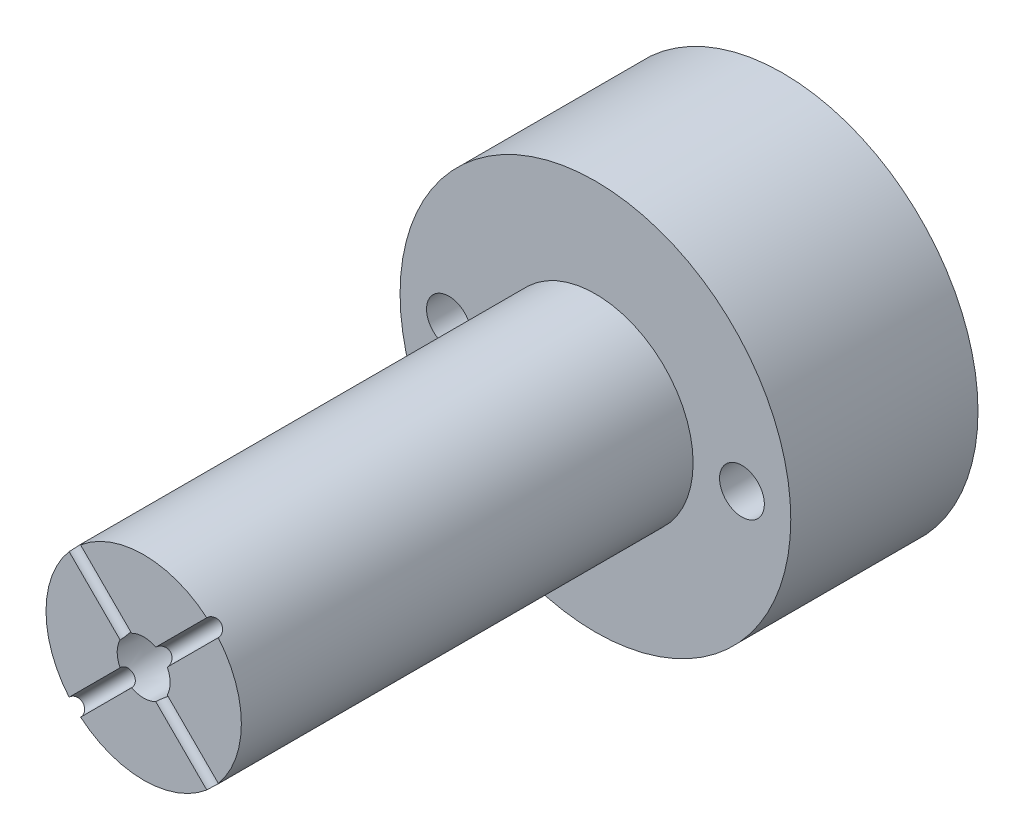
ISO-10303-21;
HEADER;
FILE_DESCRIPTION(('STEP AP214'),'2;1');
FILE_NAME('part.step','',(''),(''),'','','');
FILE_SCHEMA(('AUTOMOTIVE_DESIGN { 1 0 10303 214 1 1 1 1 }'));
ENDSEC;
DATA;
#1=APPLICATION_CONTEXT('core data for automotive mechanical design processes');
#2=APPLICATION_PROTOCOL_DEFINITION('international standard','automotive_design',2000,#1);
#3=PRODUCT_CONTEXT('',#1,'mechanical');
#4=PRODUCT('Part','Part','',(#3));
#5=PRODUCT_RELATED_PRODUCT_CATEGORY('part','',(#4));
#6=PRODUCT_DEFINITION_FORMATION('','',#4);
#7=PRODUCT_DEFINITION_CONTEXT('part definition',#1,'design');
#8=PRODUCT_DEFINITION('design','',#6,#7);
#9=PRODUCT_DEFINITION_SHAPE('','',#8);
#10=(LENGTH_UNIT() NAMED_UNIT(*) SI_UNIT(.MILLI.,.METRE.));
#11=(NAMED_UNIT(*) PLANE_ANGLE_UNIT() SI_UNIT($,.RADIAN.));
#12=(NAMED_UNIT(*) SI_UNIT($,.STERADIAN.) SOLID_ANGLE_UNIT());
#13=UNCERTAINTY_MEASURE_WITH_UNIT(LENGTH_MEASURE(1.E-05),#10,'distance_accuracy_value','');
#14=(GEOMETRIC_REPRESENTATION_CONTEXT(3) GLOBAL_UNCERTAINTY_ASSIGNED_CONTEXT((#13)) GLOBAL_UNIT_ASSIGNED_CONTEXT((#10,
#11,#12)) REPRESENTATION_CONTEXT('',''));
#15=CARTESIAN_POINT('',(0.,0.,0.));
#16=DIRECTION('',(0.,0.,1.));
#17=DIRECTION('',(1.,0.,0.));
#18=AXIS2_PLACEMENT_3D('',#15,#16,#17);
#19=CARTESIAN_POINT('',(0.,0.,55.4999999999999));
#20=DIRECTION('',(0.,0.,0.999999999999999));
#21=DIRECTION('',(1.,0.,0.));
#22=AXIS2_PLACEMENT_3D('',#19,#20,#21);
#23=PLANE('',#22);
#24=DIRECTION('',(0.707106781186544,-0.70710678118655,0.));
#25=VECTOR('',#24,1.);
#26=CARTESIAN_POINT('',(-24.7081067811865,23.2938932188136,55.4999999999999));
#27=LINE('',#26,#25);
#28=CARTESIAN_POINT('',(-2.89851335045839,1.48429978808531,55.4999999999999));
#29=VERTEX_POINT('',#28);
#30=CARTESIAN_POINT('',(-9.1628740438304,7.74866048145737,55.4999999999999));
#31=VERTEX_POINT('',#30);
#32=EDGE_CURVE('E112',#29,#31,#27,.F.);
#33=ORIENTED_EDGE('',*,*,#32,.T.);
#34=CARTESIAN_POINT('',(0.,0.,55.4999999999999));
#35=DIRECTION('',(0.,0.,0.999999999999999));
#36=DIRECTION('',(1.,0.,0.));
#37=AXIS2_PLACEMENT_3D('',#34,#35,#36);
#38=CIRCLE('',#37,12.);
#39=CARTESIAN_POINT('',(-9.16287404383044,-7.74866048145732,55.4999999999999));
#40=VERTEX_POINT('',#39);
#41=EDGE_CURVE('E121',#31,#40,#38,.T.);
#42=ORIENTED_EDGE('',*,*,#41,.T.);
#43=DIRECTION('',(0.707106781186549,0.707106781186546,0.));
#44=VECTOR('',#43,1.);
#45=CARTESIAN_POINT('',(-24.7081067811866,-23.2938932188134,55.4999999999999));
#46=LINE('',#45,#44);
#47=CARTESIAN_POINT('',(-2.89851335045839,-1.48429978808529,55.4999999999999));
#48=VERTEX_POINT('',#47);
#49=EDGE_CURVE('E190',#40,#48,#46,.T.);
#50=ORIENTED_EDGE('',*,*,#49,.T.);
#51=CARTESIAN_POINT('',(0.,0.,55.4999999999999));
#52=DIRECTION('',(0.,0.,0.999999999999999));
#53=DIRECTION('',(1.,0.,0.));
#54=AXIS2_PLACEMENT_3D('',#51,#52,#53);
#55=CIRCLE('',#54,3.25645904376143);
#56=EDGE_CURVE('E179',#48,#29,#55,.F.);
#57=ORIENTED_EDGE('',*,*,#56,.T.);
#58=EDGE_LOOP('',(#33,#42,#50,#57));
#59=FACE_BOUND('',#58,.T.);
#60=ADVANCED_FACE('F40',(#59),#23,.T.);
#61=CARTESIAN_POINT('',(2.89851335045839,1.48429978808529,55.4999999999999));
#62=VERTEX_POINT('',#61);
#63=CARTESIAN_POINT('',(2.89851335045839,-1.48429978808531,55.4999999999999));
#64=VERTEX_POINT('',#63);
#65=EDGE_CURVE('E49',#62,#64,#55,.F.);
#66=ORIENTED_EDGE('',*,*,#65,.T.);
#67=DIRECTION('',(-0.707106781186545,0.70710678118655,0.));
#68=VECTOR('',#67,1.);
#69=CARTESIAN_POINT('',(24.7081067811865,-23.2938932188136,55.4999999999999));
#70=LINE('',#69,#68);
#71=CARTESIAN_POINT('',(9.1628740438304,-7.74866048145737,55.4999999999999));
#72=VERTEX_POINT('',#71);
#73=EDGE_CURVE('E64',#72,#64,#70,.T.);
#74=ORIENTED_EDGE('',*,*,#73,.F.);
#75=CARTESIAN_POINT('',(9.16287404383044,7.74866048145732,55.4999999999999));
#76=VERTEX_POINT('',#75);
#77=EDGE_CURVE('E140',#72,#76,#38,.T.);
#78=ORIENTED_EDGE('',*,*,#77,.T.);
#79=DIRECTION('',(-0.707106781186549,-0.707106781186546,0.));
#80=VECTOR('',#79,1.);
#81=CARTESIAN_POINT('',(24.7081067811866,23.2938932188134,55.4999999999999));
#82=LINE('',#81,#80);
#83=EDGE_CURVE('E271',#62,#76,#82,.F.);
#84=ORIENTED_EDGE('',*,*,#83,.F.);
#85=EDGE_LOOP('',(#66,#74,#78,#84));
#86=FACE_BOUND('',#85,.T.);
#87=ADVANCED_FACE('F341',(#86),#23,.T.);
#88=CARTESIAN_POINT('',(-7.74866048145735,-9.16287404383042,55.4999999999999));
#89=VERTEX_POINT('',#88);
#90=CARTESIAN_POINT('',(7.7486604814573,-9.16287404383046,55.4999999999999));
#91=VERTEX_POINT('',#90);
#92=EDGE_CURVE('E132',#89,#91,#38,.T.);
#93=ORIENTED_EDGE('',*,*,#92,.T.);
#94=DIRECTION('',(-0.707106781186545,0.70710678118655,0.));
#95=VECTOR('',#94,1.);
#96=CARTESIAN_POINT('',(23.2938932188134,-24.7081067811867,55.4999999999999));
#97=LINE('',#96,#95);
#98=CARTESIAN_POINT('',(1.48429978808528,-2.8985133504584,55.4999999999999));
#99=VERTEX_POINT('',#98);
#100=EDGE_CURVE('E225',#99,#91,#97,.F.);
#101=ORIENTED_EDGE('',*,*,#100,.F.);
#102=CARTESIAN_POINT('',(-1.4842997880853,-2.89851335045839,55.4999999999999));
#103=VERTEX_POINT('',#102);
#104=EDGE_CURVE('E178',#99,#103,#55,.F.);
#105=ORIENTED_EDGE('',*,*,#104,.T.);
#106=DIRECTION('',(0.707106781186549,0.707106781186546,0.));
#107=VECTOR('',#106,1.);
#108=CARTESIAN_POINT('',(-23.2938932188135,-24.7081067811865,55.4999999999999));
#109=LINE('',#108,#107);
#110=EDGE_CURVE('E262',#103,#89,#109,.F.);
#111=ORIENTED_EDGE('',*,*,#110,.T.);
#112=EDGE_LOOP('',(#93,#101,#105,#111));
#113=FACE_BOUND('',#112,.T.);
#114=ADVANCED_FACE('F345',(#113),#23,.T.);
#115=CARTESIAN_POINT('',(0.,0.,55.4999999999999));
#116=DIRECTION('',(0.,0.,-0.999999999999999));
#117=DIRECTION('',(-1.,0.,0.));
#118=AXIS2_PLACEMENT_3D('',#115,#116,#117);
#119=CYLINDRICAL_SURFACE('',#118,12.);
#120=CARTESIAN_POINT('',(0.,0.,0.));
#121=DIRECTION('',(0.,0.,0.999999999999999));
#122=DIRECTION('',(1.,0.,0.));
#123=AXIS2_PLACEMENT_3D('',#120,#121,#122);
#124=CIRCLE('',#123,12.);
#125=CARTESIAN_POINT('',(12.,0.,0.));
#126=VERTEX_POINT('',#125);
#127=EDGE_CURVE('E151',#126,#126,#124,.T.);
#128=ORIENTED_EDGE('',*,*,#127,.T.);
#129=EDGE_LOOP('',(#128));
#130=FACE_BOUND('',#129,.T.);
#131=ORIENTED_EDGE('',*,*,#41,.F.);
#132=CARTESIAN_POINT('',(-7.74866048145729,9.16287404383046,55.4999999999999));
#133=CARTESIAN_POINT('',(-7.7486601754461,9.16287355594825,55.4719178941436));
#134=CARTESIAN_POINT('',(-7.74956748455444,9.16210711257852,55.4438492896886));
#135=CARTESIAN_POINT('',(-7.75318418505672,9.15904707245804,55.387913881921));
#136=CARTESIAN_POINT('',(-7.75589346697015,9.15675356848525,55.3600470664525));
#137=CARTESIAN_POINT('',(-7.76669219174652,9.1476000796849,55.2771025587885));
#138=CARTESIAN_POINT('',(-7.7774526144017,9.13846707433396,55.2225819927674));
#139=CARTESIAN_POINT('',(-7.80572406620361,9.11433009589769,55.1166886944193));
#140=CARTESIAN_POINT('',(-7.82323781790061,9.09932375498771,55.0653172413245));
#141=CARTESIAN_POINT('',(-7.86440846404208,9.0637639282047,54.9671627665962));
#142=CARTESIAN_POINT('',(-7.88806447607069,9.04321123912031,54.9203790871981));
#143=CARTESIAN_POINT('',(-7.94077981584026,8.9969575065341,54.8326156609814));
#144=CARTESIAN_POINT('',(-7.96985084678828,8.97124530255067,54.7916488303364));
#145=CARTESIAN_POINT('',(-8.03240669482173,8.91527905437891,54.7167851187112));
#146=CARTESIAN_POINT('',(-8.06589218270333,8.88502431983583,54.68288931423));
#147=CARTESIAN_POINT('',(-8.13624617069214,8.82064462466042,54.6230924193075));
#148=CARTESIAN_POINT('',(-8.17311941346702,8.78651422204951,54.597202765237));
#149=CARTESIAN_POINT('',(-8.24904576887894,8.71527113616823,54.5542274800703));
#150=CARTESIAN_POINT('',(-8.28809871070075,8.67815868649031,54.537141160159));
#151=CARTESIAN_POINT('',(-8.36710040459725,8.6020132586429,54.512293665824));
#152=CARTESIAN_POINT('',(-8.4070468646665,8.56298494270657,54.504510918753));
#153=CARTESIAN_POINT('',(-8.48674640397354,8.48400156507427,54.4984247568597));
#154=CARTESIAN_POINT('',(-8.52649948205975,8.44404649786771,54.5001213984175));
#155=CARTESIAN_POINT('',(-8.60458766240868,8.3644588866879,54.5129285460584));
#156=CARTESIAN_POINT('',(-8.64292605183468,8.3248257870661,54.5240155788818));
#157=CARTESIAN_POINT('',(-8.71725815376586,8.24695759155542,54.5552522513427));
#158=CARTESIAN_POINT('',(-8.75325185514,8.20872250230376,54.5754019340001));
#159=CARTESIAN_POINT('',(-8.82201846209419,8.13477385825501,54.6242185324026));
#160=CARTESIAN_POINT('',(-8.85478725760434,8.09906353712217,54.6528961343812));
#161=CARTESIAN_POINT('',(-8.91625564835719,8.03134358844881,54.7179454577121));
#162=CARTESIAN_POINT('',(-8.94495534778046,7.99933386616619,54.7543169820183));
#163=CARTESIAN_POINT('',(-8.99769893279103,7.93996214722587,54.8338480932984));
#164=CARTESIAN_POINT('',(-9.02172903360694,7.91261393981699,54.8770271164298));
#165=CARTESIAN_POINT('',(-9.06449649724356,7.86358478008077,54.9688983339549));
#166=CARTESIAN_POINT('',(-9.0832322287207,7.84190557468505,55.0175922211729));
#167=CARTESIAN_POINT('',(-9.11500225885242,7.80495550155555,55.1191309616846));
#168=CARTESIAN_POINT('',(-9.1280324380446,7.7896892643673,55.1719787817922));
#169=CARTESIAN_POINT('',(-9.14807623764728,7.76614088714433,55.2802599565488));
#170=CARTESIAN_POINT('',(-9.15509898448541,7.75784815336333,55.3356892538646));
#171=CARTESIAN_POINT('',(-9.16032709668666,7.75167135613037,55.4095838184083));
#172=CARTESIAN_POINT('',(-9.16128278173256,7.75054180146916,55.4276513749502));
#173=CARTESIAN_POINT('',(-9.16255538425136,7.74903738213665,55.4638101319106));
#174=CARTESIAN_POINT('',(-9.16287336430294,7.74866126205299,55.481901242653));
#175=CARTESIAN_POINT('',(-9.1628740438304,7.74866048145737,55.4999999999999));
#176=B_SPLINE_CURVE_WITH_KNOTS('',3,(#132,#133,#134,#135,#136,#137,#138,#139,#140,#141,#142,
#143,#144,#145,#146,#147,#148,#149,#150,#151,#152,#153,#154,#155,#156,#157,#158,#159,#160,#161,
#162,#163,#164,#165,#166,#167,#168,#169,#170,#171,#172,#173,#174,#175),.UNSPECIFIED.,.F.,.F.,(4,
2,2,2,2,2,2,2,2,2,2,2,2,2,2,2,2,2,2,2,2,4),(0.,0.0841944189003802,0.168383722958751,
0.336469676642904,0.50462346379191,0.672753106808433,0.84125042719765,1.00977338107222,
1.17853596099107,1.34728533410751,1.51564265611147,1.68400097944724,1.85193969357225,
2.01987920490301,2.18803005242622,2.35617659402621,2.52481220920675,2.69349972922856,
2.86230884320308,3.03086104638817,3.08522599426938,3.13950028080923),.UNSPECIFIED.);
#177=CARTESIAN_POINT('',(-7.74866048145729,9.16287404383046,55.4999999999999));
#178=VERTEX_POINT('',#177);
#179=EDGE_CURVE('E106',#178,#31,#176,.T.);
#180=ORIENTED_EDGE('',*,*,#179,.F.);
#181=CARTESIAN_POINT('',(7.74866048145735,9.16287404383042,55.4999999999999));
#182=VERTEX_POINT('',#181);
#183=EDGE_CURVE('E119',#182,#178,#38,.T.);
#184=ORIENTED_EDGE('',*,*,#183,.F.);
#185=CARTESIAN_POINT('',(7.74866048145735,9.16287404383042,55.4999999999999));
#186=CARTESIAN_POINT('',(7.74866017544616,9.16287355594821,55.4719178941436));
#187=CARTESIAN_POINT('',(7.7495674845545,9.16210711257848,55.4438492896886));
#188=CARTESIAN_POINT('',(7.75318418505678,9.15904707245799,55.387913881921));
#189=CARTESIAN_POINT('',(7.75589346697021,9.1567535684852,55.3600470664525));
#190=CARTESIAN_POINT('',(7.76669219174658,9.14760007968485,55.2771025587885));
#191=CARTESIAN_POINT('',(7.77745261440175,9.13846707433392,55.2225819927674));
#192=CARTESIAN_POINT('',(7.80572406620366,9.11433009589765,55.1166886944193));
#193=CARTESIAN_POINT('',(7.82323781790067,9.09932375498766,55.0653172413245));
#194=CARTESIAN_POINT('',(7.86440846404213,9.06376392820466,54.9671627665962));
#195=CARTESIAN_POINT('',(7.88806447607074,9.04321123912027,54.9203790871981));
#196=CARTESIAN_POINT('',(7.94077981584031,8.99695750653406,54.8326156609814));
#197=CARTESIAN_POINT('',(7.96985084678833,8.97124530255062,54.7916488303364));
#198=CARTESIAN_POINT('',(8.03240669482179,8.91527905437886,54.7167851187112));
#199=CARTESIAN_POINT('',(8.06589218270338,8.88502431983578,54.68288931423));
#200=CARTESIAN_POINT('',(8.13624617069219,8.82064462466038,54.6230924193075));
#201=CARTESIAN_POINT('',(8.17311941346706,8.78651422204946,54.597202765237));
#202=CARTESIAN_POINT('',(8.24904576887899,8.71527113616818,54.5542274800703));
#203=CARTESIAN_POINT('',(8.28809871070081,8.67815868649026,54.537141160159));
#204=CARTESIAN_POINT('',(8.3671004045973,8.60201325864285,54.512293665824));
#205=CARTESIAN_POINT('',(8.40704686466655,8.56298494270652,54.504510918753));
#206=CARTESIAN_POINT('',(8.48674640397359,8.48400156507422,54.4984247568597));
#207=CARTESIAN_POINT('',(8.5264994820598,8.44404649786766,54.5001213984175));
#208=CARTESIAN_POINT('',(8.60458766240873,8.36445888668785,54.5129285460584));
#209=CARTESIAN_POINT('',(8.64292605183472,8.32482578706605,54.5240155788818));
#210=CARTESIAN_POINT('',(8.71725815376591,8.24695759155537,54.5552522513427));
#211=CARTESIAN_POINT('',(8.75325185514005,8.20872250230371,54.5754019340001));
#212=CARTESIAN_POINT('',(8.82201846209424,8.13477385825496,54.6242185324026));
#213=CARTESIAN_POINT('',(8.85478725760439,8.09906353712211,54.6528961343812));
#214=CARTESIAN_POINT('',(8.91625564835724,8.03134358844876,54.7179454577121));
#215=CARTESIAN_POINT('',(8.94495534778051,7.99933386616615,54.7543169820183));
#216=CARTESIAN_POINT('',(8.99769893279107,7.93996214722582,54.8338480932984));
#217=CARTESIAN_POINT('',(9.02172903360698,7.91261393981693,54.8770271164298));
#218=CARTESIAN_POINT('',(9.06449649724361,7.86358478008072,54.9688983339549));
#219=CARTESIAN_POINT('',(9.08323222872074,7.84190557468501,55.0175922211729));
#220=CARTESIAN_POINT('',(9.11500225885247,7.8049555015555,55.1191309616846));
#221=CARTESIAN_POINT('',(9.12803243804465,7.78968926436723,55.1719787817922));
#222=CARTESIAN_POINT('',(9.14807623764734,7.76614088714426,55.2802599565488));
#223=CARTESIAN_POINT('',(9.15509898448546,7.75784815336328,55.3356892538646));
#224=CARTESIAN_POINT('',(9.16032709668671,7.75167135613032,55.4095838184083));
#225=CARTESIAN_POINT('',(9.16128278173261,7.7505418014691,55.4276513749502));
#226=CARTESIAN_POINT('',(9.16255538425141,7.74903738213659,55.4638101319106));
#227=CARTESIAN_POINT('',(9.16287336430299,7.74866126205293,55.481901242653));
#228=CARTESIAN_POINT('',(9.16287404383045,7.74866048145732,55.4999999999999));
#229=B_SPLINE_CURVE_WITH_KNOTS('',3,(#185,#186,#187,#188,#189,#190,#191,#192,#193,#194,#195,
#196,#197,#198,#199,#200,#201,#202,#203,#204,#205,#206,#207,#208,#209,#210,#211,#212,#213,#214,
#215,#216,#217,#218,#219,#220,#221,#222,#223,#224,#225,#226,#227,#228),.UNSPECIFIED.,.F.,.F.,(4,
2,2,2,2,2,2,2,2,2,2,2,2,2,2,2,2,2,2,2,2,4),(0.,0.0841944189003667,0.168383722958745,
0.336469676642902,0.504623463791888,0.672753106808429,0.841250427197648,1.00977338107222,
1.17853596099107,1.34728533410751,1.51564265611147,1.68400097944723,1.85193969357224,
2.01987920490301,2.18803005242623,2.3561765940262,2.52481220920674,2.69349972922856,
2.8623088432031,3.0308610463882,3.0852259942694,3.13950028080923),.UNSPECIFIED.);
#230=EDGE_CURVE('E279',#182,#76,#229,.T.);
#231=ORIENTED_EDGE('',*,*,#230,.T.);
#232=ORIENTED_EDGE('',*,*,#77,.F.);
#233=CARTESIAN_POINT('',(9.1628740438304,-7.74866048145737,55.4999999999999));
#234=CARTESIAN_POINT('',(9.16287355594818,-7.74866017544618,55.4719178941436));
#235=CARTESIAN_POINT('',(9.16210711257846,-7.74956748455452,55.4438492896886));
#236=CARTESIAN_POINT('',(9.15904707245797,-7.75318418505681,55.387913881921));
#237=CARTESIAN_POINT('',(9.15675356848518,-7.75589346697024,55.3600470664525));
#238=CARTESIAN_POINT('',(9.14760007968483,-7.7666921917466,55.2771025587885));
#239=CARTESIAN_POINT('',(9.13846707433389,-7.77745261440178,55.2225819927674));
#240=CARTESIAN_POINT('',(9.11433009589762,-7.80572406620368,55.1166886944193));
#241=CARTESIAN_POINT('',(9.09932375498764,-7.82323781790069,55.0653172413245));
#242=CARTESIAN_POINT('',(9.06376392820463,-7.86440846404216,54.9671627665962));
#243=CARTESIAN_POINT('',(9.04321123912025,-7.88806447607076,54.9203790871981));
#244=CARTESIAN_POINT('',(8.99695750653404,-7.94077981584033,54.8326156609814));
#245=CARTESIAN_POINT('',(8.9712453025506,-7.96985084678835,54.7916488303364));
#246=CARTESIAN_POINT('',(8.91527905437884,-8.03240669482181,54.7167851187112));
#247=CARTESIAN_POINT('',(8.88502431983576,-8.0658921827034,54.68288931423));
#248=CARTESIAN_POINT('',(8.82064462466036,-8.13624617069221,54.6230924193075));
#249=CARTESIAN_POINT('',(8.78651422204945,-8.17311941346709,54.597202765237));
#250=CARTESIAN_POINT('',(8.71527113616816,-8.24904576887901,54.5542274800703));
#251=CARTESIAN_POINT('',(8.67815868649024,-8.28809871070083,54.537141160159));
#252=CARTESIAN_POINT('',(8.60201325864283,-8.36710040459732,54.512293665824));
#253=CARTESIAN_POINT('',(8.5629849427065,-8.40704686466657,54.504510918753));
#254=CARTESIAN_POINT('',(8.4840015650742,-8.48674640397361,54.4984247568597));
#255=CARTESIAN_POINT('',(8.44404649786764,-8.52649948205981,54.5001213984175));
#256=CARTESIAN_POINT('',(8.36445888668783,-8.60458766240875,54.5129285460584));
#257=CARTESIAN_POINT('',(8.32482578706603,-8.64292605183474,54.5240155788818));
#258=CARTESIAN_POINT('',(8.24695759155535,-8.71725815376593,54.5552522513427));
#259=CARTESIAN_POINT('',(8.20872250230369,-8.75325185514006,54.5754019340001));
#260=CARTESIAN_POINT('',(8.13477385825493,-8.82201846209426,54.6242185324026));
#261=CARTESIAN_POINT('',(8.09906353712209,-8.85478725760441,54.6528961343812));
#262=CARTESIAN_POINT('',(8.03134358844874,-8.91625564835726,54.7179454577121));
#263=CARTESIAN_POINT('',(7.99933386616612,-8.94495534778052,54.7543169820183));
#264=CARTESIAN_POINT('',(7.9399621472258,-8.99769893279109,54.8338480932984));
#265=CARTESIAN_POINT('',(7.91261393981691,-9.021729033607,54.8770271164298));
#266=CARTESIAN_POINT('',(7.86358478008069,-9.06449649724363,54.9688983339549));
#267=CARTESIAN_POINT('',(7.84190557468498,-9.08323222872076,55.0175922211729));
#268=CARTESIAN_POINT('',(7.80495550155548,-9.11500225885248,55.1191309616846));
#269=CARTESIAN_POINT('',(7.78968926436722,-9.12803243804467,55.1719787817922));
#270=CARTESIAN_POINT('',(7.76614088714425,-9.14807623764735,55.2802599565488));
#271=CARTESIAN_POINT('',(7.75784815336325,-9.15509898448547,55.3356892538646));
#272=CARTESIAN_POINT('',(7.75167135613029,-9.16032709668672,55.4095838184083));
#273=CARTESIAN_POINT('',(7.75054180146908,-9.16128278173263,55.4276513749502));
#274=CARTESIAN_POINT('',(7.74903738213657,-9.16255538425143,55.4638101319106));
#275=CARTESIAN_POINT('',(7.74866126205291,-9.16287336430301,55.481901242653));
#276=CARTESIAN_POINT('',(7.7486604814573,-9.16287404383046,55.4999999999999));
#277=B_SPLINE_CURVE_WITH_KNOTS('',3,(#233,#234,#235,#236,#237,#238,#239,#240,#241,#242,#243,
#244,#245,#246,#247,#248,#249,#250,#251,#252,#253,#254,#255,#256,#257,#258,#259,#260,#261,#262,
#263,#264,#265,#266,#267,#268,#269,#270,#271,#272,#273,#274,#275,#276),.UNSPECIFIED.,.F.,.F.,(4,
2,2,2,2,2,2,2,2,2,2,2,2,2,2,2,2,2,2,2,2,4),(0.,0.0841944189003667,0.168383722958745,
0.336469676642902,0.504623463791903,0.672753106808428,0.841250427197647,1.00977338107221,
1.17853596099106,1.34728533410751,1.51564265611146,1.68400097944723,1.85193969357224,
2.01987920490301,2.18803005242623,2.3561765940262,2.52481220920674,2.69349972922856,
2.86230884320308,3.03086104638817,3.08522599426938,3.13950028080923),.UNSPECIFIED.);
#278=EDGE_CURVE('E233',#72,#91,#277,.T.);
#279=ORIENTED_EDGE('',*,*,#278,.T.);
#280=ORIENTED_EDGE('',*,*,#92,.F.);
#281=CARTESIAN_POINT('',(-9.16287404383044,-7.74866048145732,55.4999999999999));
#282=CARTESIAN_POINT('',(-9.16287355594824,-7.74866017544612,55.4719178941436));
#283=CARTESIAN_POINT('',(-9.16210711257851,-7.74956748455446,55.4438492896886));
#284=CARTESIAN_POINT('',(-9.15904707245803,-7.75318418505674,55.387913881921));
#285=CARTESIAN_POINT('',(-9.15675356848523,-7.75589346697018,55.3600470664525));
#286=CARTESIAN_POINT('',(-9.14760007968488,-7.76669219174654,55.2771025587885));
#287=CARTESIAN_POINT('',(-9.13846707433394,-7.77745261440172,55.2225819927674));
#288=CARTESIAN_POINT('',(-9.11433009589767,-7.80572406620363,55.1166886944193));
#289=CARTESIAN_POINT('',(-9.09932375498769,-7.82323781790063,55.0653172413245));
#290=CARTESIAN_POINT('',(-9.06376392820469,-7.8644084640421,54.9671627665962));
#291=CARTESIAN_POINT('',(-9.04321123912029,-7.88806447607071,54.9203790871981));
#292=CARTESIAN_POINT('',(-8.99695750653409,-7.94077981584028,54.8326156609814));
#293=CARTESIAN_POINT('',(-8.97124530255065,-7.9698508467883,54.7916488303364));
#294=CARTESIAN_POINT('',(-8.91527905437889,-8.03240669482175,54.7167851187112));
#295=CARTESIAN_POINT('',(-8.88502431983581,-8.06589218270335,54.68288931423));
#296=CARTESIAN_POINT('',(-8.8206446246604,-8.13624617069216,54.6230924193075));
#297=CARTESIAN_POINT('',(-8.78651422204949,-8.17311941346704,54.597202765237));
#298=CARTESIAN_POINT('',(-8.71527113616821,-8.24904576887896,54.5542274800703));
#299=CARTESIAN_POINT('',(-8.67815868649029,-8.28809871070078,54.537141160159));
#300=CARTESIAN_POINT('',(-8.60201325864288,-8.36710040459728,54.512293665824));
#301=CARTESIAN_POINT('',(-8.56298494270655,-8.40704686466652,54.504510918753));
#302=CARTESIAN_POINT('',(-8.48400156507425,-8.48674640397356,54.4984247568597));
#303=CARTESIAN_POINT('',(-8.44404649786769,-8.52649948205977,54.5001213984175));
#304=CARTESIAN_POINT('',(-8.36445888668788,-8.6045876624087,54.5129285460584));
#305=CARTESIAN_POINT('',(-8.32482578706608,-8.64292605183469,54.5240155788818));
#306=CARTESIAN_POINT('',(-8.2469575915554,-8.71725815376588,54.5552522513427));
#307=CARTESIAN_POINT('',(-8.20872250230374,-8.75325185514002,54.5754019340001));
#308=CARTESIAN_POINT('',(-8.13477385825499,-8.82201846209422,54.6242185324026));
#309=CARTESIAN_POINT('',(-8.09906353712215,-8.85478725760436,54.6528961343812));
#310=CARTESIAN_POINT('',(-8.03134358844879,-8.91625564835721,54.7179454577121));
#311=CARTESIAN_POINT('',(-7.99933386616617,-8.94495534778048,54.7543169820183));
#312=CARTESIAN_POINT('',(-7.93996214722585,-8.99769893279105,54.8338480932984));
#313=CARTESIAN_POINT('',(-7.91261393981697,-9.02172903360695,54.8770271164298));
#314=CARTESIAN_POINT('',(-7.86358478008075,-9.06449649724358,54.9688983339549));
#315=CARTESIAN_POINT('',(-7.84190557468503,-9.08323222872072,55.0175922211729));
#316=CARTESIAN_POINT('',(-7.80495550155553,-9.11500225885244,55.1191309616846));
#317=CARTESIAN_POINT('',(-7.78968926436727,-9.12803243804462,55.1719787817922));
#318=CARTESIAN_POINT('',(-7.7661408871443,-9.14807623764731,55.2802599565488));
#319=CARTESIAN_POINT('',(-7.75784815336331,-9.15509898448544,55.3356892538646));
#320=CARTESIAN_POINT('',(-7.75167135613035,-9.16032709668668,55.4095838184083));
#321=CARTESIAN_POINT('',(-7.75054180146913,-9.16128278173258,55.4276513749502));
#322=CARTESIAN_POINT('',(-7.74903738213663,-9.16255538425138,55.4638101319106));
#323=CARTESIAN_POINT('',(-7.74866126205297,-9.16287336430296,55.481901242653));
#324=CARTESIAN_POINT('',(-7.74866048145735,-9.16287404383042,55.4999999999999));
#325=B_SPLINE_CURVE_WITH_KNOTS('',3,(#281,#282,#283,#284,#285,#286,#287,#288,#289,#290,#291,
#292,#293,#294,#295,#296,#297,#298,#299,#300,#301,#302,#303,#304,#305,#306,#307,#308,#309,#310,
#311,#312,#313,#314,#315,#316,#317,#318,#319,#320,#321,#322,#323,#324),.UNSPECIFIED.,.F.,.F.,(4,
2,2,2,2,2,2,2,2,2,2,2,2,2,2,2,2,2,2,2,2,4),(0.,0.0841944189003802,0.168383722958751,
0.336469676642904,0.504623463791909,0.672753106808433,0.84125042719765,1.00977338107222,
1.17853596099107,1.34728533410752,1.51564265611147,1.68400097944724,1.85193969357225,
2.01987920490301,2.18803005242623,2.3561765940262,2.52481220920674,2.69349972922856,
2.8623088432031,3.0308610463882,3.08522599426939,3.13950028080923),.UNSPECIFIED.);
#326=EDGE_CURVE('E254',#40,#89,#325,.T.);
#327=ORIENTED_EDGE('',*,*,#326,.F.);
#328=EDGE_LOOP('',(#131,#180,#184,#231,#232,#279,#280,#327));
#329=FACE_BOUND('',#328,.T.);
#330=ADVANCED_FACE('F117',(#130,#329),#119,.T.);
#331=CARTESIAN_POINT('',(0.,0.,55.4999999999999));
#332=DIRECTION('',(0.,0.,0.999999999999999));
#333=DIRECTION('',(1.,0.,0.));
#334=AXIS2_PLACEMENT_3D('',#331,#332,#333);
#335=CONICAL_SURFACE('',#334,3.25645904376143,0.0174532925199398);
#336=CARTESIAN_POINT('',(-1.4843024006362,2.89851593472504,55.5001999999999));
#337=CARTESIAN_POINT('',(-1.48394092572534,2.89816302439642,55.4728847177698));
#338=CARTESIAN_POINT('',(-1.48463134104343,2.89727650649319,55.4455759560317));
#339=CARTESIAN_POINT('',(-1.48809206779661,2.89443335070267,55.3911521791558));
#340=CARTESIAN_POINT('',(-1.49086194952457,2.89247693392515,55.3640371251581));
#341=CARTESIAN_POINT('',(-1.5022293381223,2.88501505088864,55.2834214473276));
#342=CARTESIAN_POINT('',(-1.51388248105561,2.8779145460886,55.2304603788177));
#343=CARTESIAN_POINT('',(-1.5447012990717,2.8594489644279,55.1276131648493));
#344=CARTESIAN_POINT('',(-1.56386497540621,2.84808502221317,55.0777262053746));
#345=CARTESIAN_POINT('',(-1.60875014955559,2.82105511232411,54.9822304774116));
#346=CARTESIAN_POINT('',(-1.63447459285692,2.80538721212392,54.936623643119));
#347=CARTESIAN_POINT('',(-1.69212425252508,2.76922691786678,54.8496153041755));
#348=CARTESIAN_POINT('',(-1.72420114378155,2.74861319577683,54.8083647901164));
#349=CARTESIAN_POINT('',(-1.79273907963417,2.70282143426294,54.7325719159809));
#350=CARTESIAN_POINT('',(-1.82920097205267,2.67764251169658,54.6980308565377));
#351=CARTESIAN_POINT('',(-1.90603561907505,2.62218113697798,54.6358252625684));
#352=CARTESIAN_POINT('',(-1.9464818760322,2.59178953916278,54.6083482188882));
#353=CARTESIAN_POINT('',(-2.02894628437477,2.52672090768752,54.5622580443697));
#354=CARTESIAN_POINT('',(-2.07096406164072,2.49204488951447,54.5436428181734));
#355=CARTESIAN_POINT('',(-2.15395603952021,2.42000049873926,54.5162717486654));
#356=CARTESIAN_POINT('',(-2.19492997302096,2.38272150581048,54.5072802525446));
#357=CARTESIAN_POINT('',(-2.27550439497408,2.30568427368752,54.4986675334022));
#358=CARTESIAN_POINT('',(-2.31510513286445,2.26592648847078,54.4990445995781));
#359=CARTESIAN_POINT('',(-2.39054486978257,2.18640609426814,54.5089920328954));
#360=CARTESIAN_POINT('',(-2.42646241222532,2.146681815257,54.5182771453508));
#361=CARTESIAN_POINT('',(-2.4950453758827,2.06731018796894,54.54530587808));
#362=CARTESIAN_POINT('',(-2.52771063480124,2.02766284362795,54.5630499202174));
#363=CARTESIAN_POINT('',(-2.58955220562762,1.94934607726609,54.6066739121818));
#364=CARTESIAN_POINT('',(-2.61868721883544,1.91069175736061,54.632639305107));
#365=CARTESIAN_POINT('',(-2.67273620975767,1.83615400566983,54.6919085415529));
#366=CARTESIAN_POINT('',(-2.69764923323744,1.80027120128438,54.7252140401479));
#367=CARTESIAN_POINT('',(-2.74394925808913,1.73135418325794,54.7996570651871));
#368=CARTESIAN_POINT('',(-2.7651744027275,1.69847171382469,54.8410360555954));
#369=CARTESIAN_POINT('',(-2.80292680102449,1.6384916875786,54.9297316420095));
#370=CARTESIAN_POINT('',(-2.81945289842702,1.61139555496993,54.9770496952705));
#371=CARTESIAN_POINT('',(-2.84793203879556,1.56413344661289,55.0767330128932));
#372=CARTESIAN_POINT('',(-2.85985274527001,1.5440165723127,55.1291308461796));
#373=CARTESIAN_POINT('',(-2.87898035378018,1.51211499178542,55.2371844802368));
#374=CARTESIAN_POINT('',(-2.88619423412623,1.50031794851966,55.2928353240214));
#375=CARTESIAN_POINT('',(-2.89322691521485,1.48979125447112,55.3741957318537));
#376=CARTESIAN_POINT('',(-2.89492690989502,1.48744306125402,55.3993286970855));
#377=CARTESIAN_POINT('',(-2.89740761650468,1.4845335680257,55.4497055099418));
#378=CARTESIAN_POINT('',(-2.8981896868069,1.48396962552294,55.4749491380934));
#379=CARTESIAN_POINT('',(-2.89851593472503,1.48430240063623,55.5001999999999));
#380=B_SPLINE_CURVE_WITH_KNOTS('',3,(#336,#337,#338,#339,#340,#341,#342,#343,#344,#345,#346,
#347,#348,#349,#350,#351,#352,#353,#354,#355,#356,#357,#358,#359,#360,#361,#362,#363,#364,#365,
#366,#367,#368,#369,#370,#371,#372,#373,#374,#375,#376,#377,#378,#379),.UNSPECIFIED.,.F.,.F.,(4,
2,2,2,2,2,2,2,2,2,2,2,2,2,2,2,2,2,2,2,2,4),(0.,0.0819078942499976,0.163798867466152,
0.327018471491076,0.490194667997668,0.653444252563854,0.821203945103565,0.988996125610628,
1.16086556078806,1.33269433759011,1.50021194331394,1.66769895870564,1.829995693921,
1.99230052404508,2.15635081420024,2.32043813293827,2.49051361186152,2.66063090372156,
2.83192184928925,3.00295825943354,3.07879000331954,3.15450938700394),.UNSPECIFIED.);
#381=CARTESIAN_POINT('',(-1.48429978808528,2.8985133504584,55.4999999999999));
#382=VERTEX_POINT('',#381);
#383=EDGE_CURVE('E56',#382,#29,#380,.T.);
#384=ORIENTED_EDGE('',*,*,#383,.T.);
#385=ORIENTED_EDGE('',*,*,#56,.F.);
#386=CARTESIAN_POINT('',(-2.89851593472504,-1.48430240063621,55.5001999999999));
#387=CARTESIAN_POINT('',(-2.89816302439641,-1.48394092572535,55.4728847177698));
#388=CARTESIAN_POINT('',(-2.89727650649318,-1.48463134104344,55.4455759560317));
#389=CARTESIAN_POINT('',(-2.89443335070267,-1.48809206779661,55.3911521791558));
#390=CARTESIAN_POINT('',(-2.89247693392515,-1.49086194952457,55.3640371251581));
#391=CARTESIAN_POINT('',(-2.88501505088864,-1.5022293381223,55.2834214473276));
#392=CARTESIAN_POINT('',(-2.87791454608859,-1.51388248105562,55.2304603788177));
#393=CARTESIAN_POINT('',(-2.85944896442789,-1.54470129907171,55.1276131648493));
#394=CARTESIAN_POINT('',(-2.84808502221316,-1.56386497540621,55.0777262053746));
#395=CARTESIAN_POINT('',(-2.82105511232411,-1.6087501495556,54.9822304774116));
#396=CARTESIAN_POINT('',(-2.80538721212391,-1.63447459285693,54.936623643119));
#397=CARTESIAN_POINT('',(-2.76922691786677,-1.69212425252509,54.8496153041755));
#398=CARTESIAN_POINT('',(-2.74861319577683,-1.72420114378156,54.8083647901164));
#399=CARTESIAN_POINT('',(-2.70282143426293,-1.79273907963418,54.7325719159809));
#400=CARTESIAN_POINT('',(-2.67764251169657,-1.82920097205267,54.6980308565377));
#401=CARTESIAN_POINT('',(-2.62218113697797,-1.90603561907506,54.6358252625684));
#402=CARTESIAN_POINT('',(-2.59178953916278,-1.94648187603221,54.6083482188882));
#403=CARTESIAN_POINT('',(-2.52672090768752,-2.02894628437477,54.5622580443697));
#404=CARTESIAN_POINT('',(-2.49204488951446,-2.07096406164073,54.5436428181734));
#405=CARTESIAN_POINT('',(-2.42000049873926,-2.15395603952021,54.5162717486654));
#406=CARTESIAN_POINT('',(-2.38272150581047,-2.19492997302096,54.5072802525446));
#407=CARTESIAN_POINT('',(-2.30568427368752,-2.27550439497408,54.4986675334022));
#408=CARTESIAN_POINT('',(-2.26592648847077,-2.31510513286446,54.4990445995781));
#409=CARTESIAN_POINT('',(-2.18640609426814,-2.39054486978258,54.5089920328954));
#410=CARTESIAN_POINT('',(-2.14668181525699,-2.42646241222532,54.5182771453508));
#411=CARTESIAN_POINT('',(-2.06731018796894,-2.4950453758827,54.54530587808));
#412=CARTESIAN_POINT('',(-2.02766284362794,-2.52771063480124,54.5630499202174));
#413=CARTESIAN_POINT('',(-1.94934607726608,-2.58955220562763,54.6066739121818));
#414=CARTESIAN_POINT('',(-1.9106917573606,-2.61868721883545,54.632639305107));
#415=CARTESIAN_POINT('',(-1.83615400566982,-2.67273620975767,54.6919085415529));
#416=CARTESIAN_POINT('',(-1.80027120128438,-2.69764923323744,54.7252140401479));
#417=CARTESIAN_POINT('',(-1.73135418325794,-2.74394925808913,54.7996570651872));
#418=CARTESIAN_POINT('',(-1.69847171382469,-2.76517440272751,54.8410360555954));
#419=CARTESIAN_POINT('',(-1.63849168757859,-2.80292680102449,54.9297316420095));
#420=CARTESIAN_POINT('',(-1.61139555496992,-2.81945289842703,54.9770496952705));
#421=CARTESIAN_POINT('',(-1.56413344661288,-2.84793203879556,55.0767330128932));
#422=CARTESIAN_POINT('',(-1.5440165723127,-2.85985274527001,55.1291308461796));
#423=CARTESIAN_POINT('',(-1.51211499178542,-2.87898035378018,55.2371844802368));
#424=CARTESIAN_POINT('',(-1.50031794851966,-2.88619423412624,55.2928353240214));
#425=CARTESIAN_POINT('',(-1.48979125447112,-2.89322691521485,55.3741957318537));
#426=CARTESIAN_POINT('',(-1.48744306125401,-2.89492690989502,55.3993286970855));
#427=CARTESIAN_POINT('',(-1.4845335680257,-2.89740761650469,55.4497055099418));
#428=CARTESIAN_POINT('',(-1.48396962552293,-2.8981896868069,55.4749491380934));
#429=CARTESIAN_POINT('',(-1.48430240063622,-2.89851593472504,55.5001999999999));
#430=B_SPLINE_CURVE_WITH_KNOTS('',3,(#386,#387,#388,#389,#390,#391,#392,#393,#394,#395,#396,
#397,#398,#399,#400,#401,#402,#403,#404,#405,#406,#407,#408,#409,#410,#411,#412,#413,#414,#415,
#416,#417,#418,#419,#420,#421,#422,#423,#424,#425,#426,#427,#428,#429),.UNSPECIFIED.,.F.,.F.,(4,
2,2,2,2,2,2,2,2,2,2,2,2,2,2,2,2,2,2,2,2,4),(0.,0.0819078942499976,0.163798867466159,
0.327018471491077,0.49019466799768,0.653444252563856,0.821203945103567,0.988996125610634,
1.16086556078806,1.33269433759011,1.50021194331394,1.66769895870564,1.82999569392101,
1.99230052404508,2.15635081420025,2.32043813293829,2.49051361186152,2.66063090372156,
2.83192184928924,3.00295825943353,3.07879000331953,3.15450938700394),.UNSPECIFIED.);
#431=EDGE_CURVE('E195',#48,#103,#430,.T.);
#432=ORIENTED_EDGE('',*,*,#431,.T.);
#433=ORIENTED_EDGE('',*,*,#104,.F.);
#434=CARTESIAN_POINT('',(2.89851593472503,-1.48430240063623,55.5001999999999));
#435=CARTESIAN_POINT('',(2.89816302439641,-1.48394092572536,55.4728847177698));
#436=CARTESIAN_POINT('',(2.89727650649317,-1.48463134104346,55.4455759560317));
#437=CARTESIAN_POINT('',(2.89443335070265,-1.48809206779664,55.3911521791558));
#438=CARTESIAN_POINT('',(2.89247693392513,-1.4908619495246,55.3640371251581));
#439=CARTESIAN_POINT('',(2.88501505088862,-1.50222933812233,55.2834214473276));
#440=CARTESIAN_POINT('',(2.87791454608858,-1.51388248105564,55.2304603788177));
#441=CARTESIAN_POINT('',(2.85944896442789,-1.54470129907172,55.1276131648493));
#442=CARTESIAN_POINT('',(2.84808502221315,-1.56386497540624,55.0777262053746));
#443=CARTESIAN_POINT('',(2.8210551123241,-1.60875014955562,54.9822304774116));
#444=CARTESIAN_POINT('',(2.8053872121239,-1.63447459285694,54.936623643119));
#445=CARTESIAN_POINT('',(2.76922691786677,-1.6921242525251,54.8496153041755));
#446=CARTESIAN_POINT('',(2.74861319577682,-1.72420114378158,54.8083647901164));
#447=CARTESIAN_POINT('',(2.70282143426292,-1.7927390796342,54.7325719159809));
#448=CARTESIAN_POINT('',(2.67764251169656,-1.82920097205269,54.6980308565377));
#449=CARTESIAN_POINT('',(2.62218113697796,-1.90603561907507,54.6358252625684));
#450=CARTESIAN_POINT('',(2.59178953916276,-1.94648187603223,54.6083482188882));
#451=CARTESIAN_POINT('',(2.52672090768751,-2.02894628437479,54.5622580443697));
#452=CARTESIAN_POINT('',(2.49204488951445,-2.07096406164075,54.5436428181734));
#453=CARTESIAN_POINT('',(2.42000049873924,-2.15395603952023,54.5162717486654));
#454=CARTESIAN_POINT('',(2.38272150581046,-2.19492997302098,54.5072802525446));
#455=CARTESIAN_POINT('',(2.30568427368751,-2.2755043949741,54.4986675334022));
#456=CARTESIAN_POINT('',(2.26592648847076,-2.31510513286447,54.4990445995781));
#457=CARTESIAN_POINT('',(2.18640609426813,-2.39054486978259,54.5089920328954));
#458=CARTESIAN_POINT('',(2.14668181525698,-2.42646241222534,54.5182771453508));
#459=CARTESIAN_POINT('',(2.06731018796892,-2.49504537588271,54.54530587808));
#460=CARTESIAN_POINT('',(2.02766284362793,-2.52771063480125,54.5630499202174));
#461=CARTESIAN_POINT('',(1.94934607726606,-2.58955220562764,54.6066739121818));
#462=CARTESIAN_POINT('',(1.91069175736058,-2.61868721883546,54.632639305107));
#463=CARTESIAN_POINT('',(1.8361540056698,-2.67273620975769,54.6919085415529));
#464=CARTESIAN_POINT('',(1.80027120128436,-2.69764923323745,54.7252140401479));
#465=CARTESIAN_POINT('',(1.73135418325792,-2.74394925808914,54.7996570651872));
#466=CARTESIAN_POINT('',(1.69847171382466,-2.76517440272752,54.8410360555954));
#467=CARTESIAN_POINT('',(1.63849168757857,-2.80292680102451,54.9297316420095));
#468=CARTESIAN_POINT('',(1.61139555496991,-2.81945289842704,54.9770496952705));
#469=CARTESIAN_POINT('',(1.56413344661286,-2.84793203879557,55.0767330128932));
#470=CARTESIAN_POINT('',(1.54401657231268,-2.85985274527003,55.1291308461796));
#471=CARTESIAN_POINT('',(1.51211499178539,-2.87898035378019,55.2371844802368));
#472=CARTESIAN_POINT('',(1.50031794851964,-2.88619423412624,55.2928353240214));
#473=CARTESIAN_POINT('',(1.4897912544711,-2.89322691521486,55.3741957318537));
#474=CARTESIAN_POINT('',(1.48744306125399,-2.89492690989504,55.3993286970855));
#475=CARTESIAN_POINT('',(1.48453356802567,-2.8974076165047,55.4497055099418));
#476=CARTESIAN_POINT('',(1.4839696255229,-2.89818968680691,55.4749491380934));
#477=CARTESIAN_POINT('',(1.4843024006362,-2.89851593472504,55.5001999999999));
#478=B_SPLINE_CURVE_WITH_KNOTS('',3,(#434,#435,#436,#437,#438,#439,#440,#441,#442,#443,#444,
#445,#446,#447,#448,#449,#450,#451,#452,#453,#454,#455,#456,#457,#458,#459,#460,#461,#462,#463,
#464,#465,#466,#467,#468,#469,#470,#471,#472,#473,#474,#475,#476,#477),.UNSPECIFIED.,.F.,.F.,(4,
2,2,2,2,2,2,2,2,2,2,2,2,2,2,2,2,2,2,2,2,4),(0.,0.0819078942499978,0.163798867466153,
0.327018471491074,0.490194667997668,0.653444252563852,0.821203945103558,0.98899612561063,
1.16086556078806,1.33269433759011,1.50021194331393,1.66769895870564,1.829995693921,
1.99230052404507,2.15635081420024,2.32043813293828,2.49051361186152,2.66063090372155,
2.83192184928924,3.00295825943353,3.07879000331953,3.15450938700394),.UNSPECIFIED.);
#479=EDGE_CURVE('E123',#64,#99,#478,.T.);
#480=ORIENTED_EDGE('',*,*,#479,.F.);
#481=ORIENTED_EDGE('',*,*,#65,.F.);
#482=CARTESIAN_POINT('',(1.48430240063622,2.89851593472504,55.5001999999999));
#483=CARTESIAN_POINT('',(1.48394092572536,2.89816302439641,55.4728847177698));
#484=CARTESIAN_POINT('',(1.48463134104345,2.89727650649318,55.4455759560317));
#485=CARTESIAN_POINT('',(1.48809206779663,2.89443335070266,55.3911521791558));
#486=CARTESIAN_POINT('',(1.49086194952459,2.89247693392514,55.3640371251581));
#487=CARTESIAN_POINT('',(1.50222933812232,2.88501505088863,55.2834214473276));
#488=CARTESIAN_POINT('',(1.51388248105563,2.87791454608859,55.2304603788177));
#489=CARTESIAN_POINT('',(1.54470129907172,2.85944896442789,55.1276131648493));
#490=CARTESIAN_POINT('',(1.56386497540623,2.84808502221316,55.0777262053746));
#491=CARTESIAN_POINT('',(1.60875014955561,2.8210551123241,54.9822304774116));
#492=CARTESIAN_POINT('',(1.63447459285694,2.80538721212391,54.936623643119));
#493=CARTESIAN_POINT('',(1.69212425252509,2.76922691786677,54.8496153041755));
#494=CARTESIAN_POINT('',(1.72420114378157,2.74861319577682,54.8083647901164));
#495=CARTESIAN_POINT('',(1.79273907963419,2.70282143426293,54.7325719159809));
#496=CARTESIAN_POINT('',(1.82920097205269,2.67764251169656,54.6980308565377));
#497=CARTESIAN_POINT('',(1.90603561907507,2.62218113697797,54.6358252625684));
#498=CARTESIAN_POINT('',(1.94648187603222,2.59178953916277,54.6083482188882));
#499=CARTESIAN_POINT('',(2.02894628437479,2.52672090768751,54.5622580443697));
#500=CARTESIAN_POINT('',(2.07096406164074,2.49204488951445,54.5436428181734));
#501=CARTESIAN_POINT('',(2.15395603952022,2.42000049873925,54.5162717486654));
#502=CARTESIAN_POINT('',(2.19492997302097,2.38272150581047,54.5072802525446));
#503=CARTESIAN_POINT('',(2.27550439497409,2.30568427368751,54.4986675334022));
#504=CARTESIAN_POINT('',(2.31510513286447,2.26592648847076,54.4990445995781));
#505=CARTESIAN_POINT('',(2.39054486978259,2.18640609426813,54.5089920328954));
#506=CARTESIAN_POINT('',(2.42646241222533,2.14668181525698,54.5182771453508));
#507=CARTESIAN_POINT('',(2.49504537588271,2.06731018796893,54.54530587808));
#508=CARTESIAN_POINT('',(2.52771063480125,2.02766284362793,54.5630499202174));
#509=CARTESIAN_POINT('',(2.58955220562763,1.94934607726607,54.6066739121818));
#510=CARTESIAN_POINT('',(2.61868721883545,1.91069175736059,54.632639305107));
#511=CARTESIAN_POINT('',(2.67273620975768,1.83615400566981,54.6919085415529));
#512=CARTESIAN_POINT('',(2.69764923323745,1.80027120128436,54.7252140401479));
#513=CARTESIAN_POINT('',(2.74394925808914,1.73135418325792,54.7996570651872));
#514=CARTESIAN_POINT('',(2.76517440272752,1.69847171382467,54.8410360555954));
#515=CARTESIAN_POINT('',(2.8029268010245,1.63849168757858,54.9297316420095));
#516=CARTESIAN_POINT('',(2.81945289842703,1.61139555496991,54.9770496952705));
#517=CARTESIAN_POINT('',(2.84793203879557,1.56413344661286,55.0767330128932));
#518=CARTESIAN_POINT('',(2.85985274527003,1.54401657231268,55.1291308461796));
#519=CARTESIAN_POINT('',(2.87898035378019,1.5121149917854,55.2371844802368));
#520=CARTESIAN_POINT('',(2.88619423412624,1.50031794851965,55.2928353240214));
#521=CARTESIAN_POINT('',(2.89322691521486,1.4897912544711,55.3741957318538));
#522=CARTESIAN_POINT('',(2.89492690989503,1.48744306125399,55.3993286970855));
#523=CARTESIAN_POINT('',(2.8974076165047,1.48453356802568,55.4497055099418));
#524=CARTESIAN_POINT('',(2.89818968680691,1.48396962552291,55.4749491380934));
#525=CARTESIAN_POINT('',(2.89851593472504,1.48430240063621,55.5001999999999));
#526=B_SPLINE_CURVE_WITH_KNOTS('',3,(#482,#483,#484,#485,#486,#487,#488,#489,#490,#491,#492,
#493,#494,#495,#496,#497,#498,#499,#500,#501,#502,#503,#504,#505,#506,#507,#508,#509,#510,#511,
#512,#513,#514,#515,#516,#517,#518,#519,#520,#521,#522,#523,#524,#525),.UNSPECIFIED.,.F.,.F.,(4,
2,2,2,2,2,2,2,2,2,2,2,2,2,2,2,2,2,2,2,2,4),(0.,0.0819078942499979,0.163798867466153,
0.327018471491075,0.490194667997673,0.653444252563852,0.821203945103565,0.988996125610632,
1.16086556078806,1.33269433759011,1.50021194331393,1.66769895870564,1.82999569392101,
1.99230052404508,2.15635081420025,2.32043813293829,2.49051361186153,2.66063090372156,
2.83192184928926,3.00295825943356,3.07879000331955,3.15450938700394),.UNSPECIFIED.);
#527=CARTESIAN_POINT('',(1.4842997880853,2.89851335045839,55.4999999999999));
#528=VERTEX_POINT('',#527);
#529=EDGE_CURVE('E261',#528,#62,#526,.T.);
#530=ORIENTED_EDGE('',*,*,#529,.F.);
#531=EDGE_CURVE('E171',#382,#528,#55,.F.);
#532=ORIENTED_EDGE('',*,*,#531,.F.);
#533=EDGE_LOOP('',(#384,#385,#432,#433,#480,#481,#530,#532));
#534=FACE_BOUND('',#533,.T.);
#535=CARTESIAN_POINT('',(0.,0.,-2.16000000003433));
#536=DIRECTION('',(0.,0.,0.999999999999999));
#537=DIRECTION('',(1.,0.,0.));
#538=AXIS2_PLACEMENT_3D('',#535,#536,#537);
#539=CIRCLE('',#538,2.25);
#540=CARTESIAN_POINT('',(-2.25,0.,-2.16000000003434));
#541=VERTEX_POINT('',#540);
#542=EDGE_CURVE('E11',#541,#541,#539,.T.);
#543=ORIENTED_EDGE('',*,*,#542,.F.);
#544=EDGE_LOOP('',(#543));
#545=FACE_BOUND('',#544,.T.);
#546=ADVANCED_FACE('F42',(#534,#545),#335,.F.);
#547=DIRECTION('',(0.707106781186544,-0.70710678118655,0.));
#548=VECTOR('',#547,1.);
#549=CARTESIAN_POINT('',(-23.2938932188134,24.7081067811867,55.4999999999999));
#550=LINE('',#549,#548);
#551=EDGE_CURVE('E103',#178,#382,#550,.T.);
#552=ORIENTED_EDGE('',*,*,#551,.T.);
#553=ORIENTED_EDGE('',*,*,#531,.T.);
#554=DIRECTION('',(-0.707106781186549,-0.707106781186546,0.));
#555=VECTOR('',#554,1.);
#556=CARTESIAN_POINT('',(23.2938932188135,24.7081067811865,55.4999999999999));
#557=LINE('',#556,#555);
#558=EDGE_CURVE('E128',#182,#528,#557,.T.);
#559=ORIENTED_EDGE('',*,*,#558,.F.);
#560=ORIENTED_EDGE('',*,*,#183,.T.);
#561=EDGE_LOOP('',(#552,#553,#559,#560));
#562=FACE_BOUND('',#561,.T.);
#563=ADVANCED_FACE('F126',(#562),#23,.T.);
#564=CARTESIAN_POINT('',(0.,0.,-23.));
#565=DIRECTION('',(0.,0.,0.999999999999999));
#566=DIRECTION('',(1.,0.,0.));
#567=AXIS2_PLACEMENT_3D('',#564,#565,#566);
#568=PLANE('',#567);
#569=CARTESIAN_POINT('',(-18.,0.,-23.));
#570=DIRECTION('',(0.,0.,-0.999999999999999));
#571=DIRECTION('',(-1.,0.,0.));
#572=AXIS2_PLACEMENT_3D('',#569,#570,#571);
#573=CIRCLE('',#572,5.);
#574=CARTESIAN_POINT('',(-23.,0.,-23.));
#575=VERTEX_POINT('',#574);
#576=EDGE_CURVE('E300',#575,#575,#573,.T.);
#577=ORIENTED_EDGE('',*,*,#576,.F.);
#578=EDGE_LOOP('',(#577));
#579=FACE_BOUND('',#578,.T.);
#580=CARTESIAN_POINT('',(18.,0.,-23.));
#581=DIRECTION('',(0.,0.,-0.999999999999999));
#582=DIRECTION('',(-1.,0.,0.));
#583=AXIS2_PLACEMENT_3D('',#580,#581,#582);
#584=CIRCLE('',#583,5.);
#585=CARTESIAN_POINT('',(13.,0.,-23.));
#586=VERTEX_POINT('',#585);
#587=EDGE_CURVE('E305',#586,#586,#584,.T.);
#588=ORIENTED_EDGE('',*,*,#587,.F.);
#589=EDGE_LOOP('',(#588));
#590=FACE_BOUND('',#589,.T.);
#591=CARTESIAN_POINT('',(0.,0.,-23.));
#592=DIRECTION('',(0.,0.,0.999999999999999));
#593=DIRECTION('',(1.,0.,0.));
#594=AXIS2_PLACEMENT_3D('',#591,#592,#593);
#595=CIRCLE('',#594,24.);
#596=CARTESIAN_POINT('',(24.,0.,-23.));
#597=VERTEX_POINT('',#596);
#598=EDGE_CURVE('E137',#597,#597,#595,.T.);
#599=ORIENTED_EDGE('',*,*,#598,.F.);
#600=EDGE_LOOP('',(#599));
#601=FACE_BOUND('',#600,.T.);
#602=CARTESIAN_POINT('',(0.,0.,-23.));
#603=DIRECTION('',(0.,0.,0.999999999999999));
#604=DIRECTION('',(1.,0.,0.));
#605=AXIS2_PLACEMENT_3D('',#602,#603,#604);
#606=CIRCLE('',#605,12.369316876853);
#607=CARTESIAN_POINT('',(-12.369316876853,0.,-23.));
#608=VERTEX_POINT('',#607);
#609=EDGE_CURVE('E159',#608,#608,#606,.F.);
#610=ORIENTED_EDGE('',*,*,#609,.F.);
#611=EDGE_LOOP('',(#610));
#612=FACE_BOUND('',#611,.T.);
#613=ADVANCED_FACE('F315',(#579,#590,#601,#612),#568,.F.);
#614=CARTESIAN_POINT('',(0.,0.,0.));
#615=DIRECTION('',(0.,0.,0.999999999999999));
#616=DIRECTION('',(1.,0.,0.));
#617=AXIS2_PLACEMENT_3D('',#614,#615,#616);
#618=PLANE('',#617);
#619=CARTESIAN_POINT('',(18.,0.,0.));
#620=DIRECTION('',(0.,0.,0.999999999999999));
#621=DIRECTION('',(1.,0.,0.));
#622=AXIS2_PLACEMENT_3D('',#619,#620,#621);
#623=CIRCLE('',#622,2.75);
#624=CARTESIAN_POINT('',(15.25,0.,0.));
#625=VERTEX_POINT('',#624);
#626=EDGE_CURVE('E289',#625,#625,#623,.T.);
#627=ORIENTED_EDGE('',*,*,#626,.F.);
#628=EDGE_LOOP('',(#627));
#629=FACE_BOUND('',#628,.T.);
#630=CARTESIAN_POINT('',(-18.,0.,0.));
#631=DIRECTION('',(0.,0.,0.999999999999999));
#632=DIRECTION('',(1.,0.,0.));
#633=AXIS2_PLACEMENT_3D('',#630,#631,#632);
#634=CIRCLE('',#633,2.75);
#635=CARTESIAN_POINT('',(-20.75,0.,0.));
#636=VERTEX_POINT('',#635);
#637=EDGE_CURVE('E296',#636,#636,#634,.T.);
#638=ORIENTED_EDGE('',*,*,#637,.F.);
#639=EDGE_LOOP('',(#638));
#640=FACE_BOUND('',#639,.T.);
#641=CARTESIAN_POINT('',(0.,0.,0.));
#642=DIRECTION('',(0.,0.,0.999999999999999));
#643=DIRECTION('',(1.,0.,0.));
#644=AXIS2_PLACEMENT_3D('',#641,#642,#643);
#645=CIRCLE('',#644,24.);
#646=CARTESIAN_POINT('',(24.,0.,0.));
#647=VERTEX_POINT('',#646);
#648=EDGE_CURVE('E130',#647,#647,#645,.T.);
#649=ORIENTED_EDGE('',*,*,#648,.T.);
#650=EDGE_LOOP('',(#649));
#651=FACE_BOUND('',#650,.T.);
#652=ORIENTED_EDGE('',*,*,#127,.F.);
#653=EDGE_LOOP('',(#652));
#654=FACE_BOUND('',#653,.T.);
#655=ADVANCED_FACE('F318',(#629,#640,#651,#654),#618,.T.);
#656=CARTESIAN_POINT('',(0.,0.,-23.));
#657=DIRECTION('',(0.,0.,0.999999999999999));
#658=DIRECTION('',(1.,0.,0.));
#659=AXIS2_PLACEMENT_3D('',#656,#657,#658);
#660=CYLINDRICAL_SURFACE('',#659,24.);
#661=CARTESIAN_POINT('',(24.,0.,-23.));
#662=CARTESIAN_POINT('',(24.,0.,-22.7604166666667));
#663=CARTESIAN_POINT('',(24.,0.,-22.5208333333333));
#664=CARTESIAN_POINT('',(24.,0.,-22.0416666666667));
#665=CARTESIAN_POINT('',(24.,0.,-21.8020833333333));
#666=CARTESIAN_POINT('',(24.,0.,-21.3229166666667));
#667=CARTESIAN_POINT('',(24.,0.,-21.0833333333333));
#668=CARTESIAN_POINT('',(24.,0.,-20.6041666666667));
#669=CARTESIAN_POINT('',(24.,0.,-20.3645833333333));
#670=CARTESIAN_POINT('',(24.,0.,-19.8854166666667));
#671=CARTESIAN_POINT('',(24.,0.,-19.6458333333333));
#672=CARTESIAN_POINT('',(24.,0.,-19.1666666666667));
#673=CARTESIAN_POINT('',(24.,0.,-18.9270833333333));
#674=CARTESIAN_POINT('',(24.,0.,-18.4479166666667));
#675=CARTESIAN_POINT('',(24.,0.,-18.2083333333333));
#676=CARTESIAN_POINT('',(24.,0.,-17.7291666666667));
#677=CARTESIAN_POINT('',(24.,0.,-17.4895833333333));
#678=CARTESIAN_POINT('',(24.,0.,-17.0104166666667));
#679=CARTESIAN_POINT('',(24.,0.,-16.7708333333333));
#680=CARTESIAN_POINT('',(24.,0.,-16.2916666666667));
#681=CARTESIAN_POINT('',(24.,0.,-16.0520833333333));
#682=CARTESIAN_POINT('',(24.,0.,-15.5729166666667));
#683=CARTESIAN_POINT('',(24.,0.,-15.3333333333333));
#684=CARTESIAN_POINT('',(24.,0.,-14.8541666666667));
#685=CARTESIAN_POINT('',(24.,0.,-14.6145833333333));
#686=CARTESIAN_POINT('',(24.,0.,-14.1354166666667));
#687=CARTESIAN_POINT('',(24.,0.,-13.8958333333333));
#688=CARTESIAN_POINT('',(24.,0.,-13.4166666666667));
#689=CARTESIAN_POINT('',(24.,0.,-13.1770833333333));
#690=CARTESIAN_POINT('',(24.,0.,-12.6979166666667));
#691=CARTESIAN_POINT('',(24.,0.,-12.4583333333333));
#692=CARTESIAN_POINT('',(24.,0.,-11.9791666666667));
#693=CARTESIAN_POINT('',(24.,0.,-11.7395833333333));
#694=CARTESIAN_POINT('',(24.,0.,-11.2604166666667));
#695=CARTESIAN_POINT('',(24.,0.,-11.0208333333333));
#696=CARTESIAN_POINT('',(24.,0.,-10.5416666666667));
#697=CARTESIAN_POINT('',(24.,0.,-10.3020833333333));
#698=CARTESIAN_POINT('',(24.,0.,-9.82291666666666));
#699=CARTESIAN_POINT('',(24.,0.,-9.58333333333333));
#700=CARTESIAN_POINT('',(24.,0.,-9.10416666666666));
#701=CARTESIAN_POINT('',(24.,0.,-8.86458333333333));
#702=CARTESIAN_POINT('',(24.,0.,-8.38541666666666));
#703=CARTESIAN_POINT('',(24.,0.,-8.14583333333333));
#704=CARTESIAN_POINT('',(24.,0.,-7.66666666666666));
#705=CARTESIAN_POINT('',(24.,0.,-7.42708333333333));
#706=CARTESIAN_POINT('',(24.,0.,-6.94791666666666));
#707=CARTESIAN_POINT('',(24.,0.,-6.70833333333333));
#708=CARTESIAN_POINT('',(24.,0.,-6.22916666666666));
#709=CARTESIAN_POINT('',(24.,0.,-5.98958333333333));
#710=CARTESIAN_POINT('',(24.,0.,-5.51041666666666));
#711=CARTESIAN_POINT('',(24.,0.,-5.27083333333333));
#712=CARTESIAN_POINT('',(24.,0.,-4.79166666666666));
#713=CARTESIAN_POINT('',(24.,0.,-4.55208333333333));
#714=CARTESIAN_POINT('',(24.,0.,-4.07291666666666));
#715=CARTESIAN_POINT('',(24.,0.,-3.83333333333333));
#716=CARTESIAN_POINT('',(24.,0.,-3.35416666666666));
#717=CARTESIAN_POINT('',(24.,0.,-3.11458333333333));
#718=CARTESIAN_POINT('',(24.,0.,-2.63541666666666));
#719=CARTESIAN_POINT('',(24.,0.,-2.39583333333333));
#720=CARTESIAN_POINT('',(24.,0.,-1.91666666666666));
#721=CARTESIAN_POINT('',(24.,0.,-1.67708333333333));
#722=CARTESIAN_POINT('',(24.,0.,-1.19791666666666));
#723=CARTESIAN_POINT('',(24.,0.,-0.95833333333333));
#724=CARTESIAN_POINT('',(24.,0.,-0.479166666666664));
#725=CARTESIAN_POINT('',(24.,0.,-0.23958333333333));
#726=CARTESIAN_POINT('',(24.,0.,0.));
#727=B_SPLINE_CURVE_WITH_KNOTS('',3,(#661,#662,#663,#664,#665,#666,#667,#668,#669,#670,#671,
#672,#673,#674,#675,#676,#677,#678,#679,#680,#681,#682,#683,#684,#685,#686,#687,#688,#689,#690,
#691,#692,#693,#694,#695,#696,#697,#698,#699,#700,#701,#702,#703,#704,#705,#706,#707,#708,#709,
#710,#711,#712,#713,#714,#715,#716,#717,#718,#719,#720,#721,#722,#723,#724,#725,#726),
.UNSPECIFIED.,.F.,.F.,(4,2,2,2,2,2,2,2,2,2,2,2,2,2,2,2,2,2,2,2,2,2,2,2,2,2,2,2,2,2,2,2,4),(0.,
0.718749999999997,1.4375,2.15625,2.875,3.59375,4.3125,5.03125,5.74999999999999,6.46875,7.1875,
7.90625,8.62499999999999,9.34375,10.0625,10.78125,11.5,12.21875,12.9375,13.65625,14.375,
15.09375,15.8125,16.53125,17.25,17.96875,18.6875,19.40625,20.125,20.84375,21.5625,22.28125,23.),.UNSPECIFIED.);
#728=EDGE_CURVE('BSEAM328',#597,#647,#727,.T.);
#729=ORIENTED_EDGE('',*,*,#598,.T.);
#730=ORIENTED_EDGE('',*,*,#648,.F.);
#731=ORIENTED_EDGE('',*,*,#728,.T.);
#732=ORIENTED_EDGE('',*,*,#728,.F.);
#733=EDGE_LOOP('',(#729,#731,#730,#732));
#734=FACE_BOUND('',#733,.T.);
#735=ADVANCED_FACE('F328',(#734),#660,.T.);
#736=CARTESIAN_POINT('',(0.,0.,-27.));
#737=DIRECTION('',(0.,0.,-0.999999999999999));
#738=DIRECTION('',(-1.,0.,0.));
#739=AXIS2_PLACEMENT_3D('',#736,#737,#738);
#740=SPHERICAL_SURFACE('',#739,13.);
#741=CARTESIAN_POINT('',(0.,0.,-14.1961919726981));
#742=DIRECTION('',(0.,0.,-0.999999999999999));
#743=DIRECTION('',(-1.,0.,0.));
#744=AXIS2_PLACEMENT_3D('',#741,#742,#743);
#745=CIRCLE('',#744,2.25);
#746=CARTESIAN_POINT('',(-2.24999999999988,0.,-14.1961919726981));
#747=VERTEX_POINT('',#746);
#748=EDGE_CURVE('E166',#747,#747,#745,.T.);
#749=CARTESIAN_POINT('',(-2.24999999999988,0.,-14.1961919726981));
#750=CARTESIAN_POINT('',(-2.39458677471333,0.,-14.2215990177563));
#751=CARTESIAN_POINT('',(-2.53874276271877,0.,-14.2494571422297));
#752=CARTESIAN_POINT('',(-2.82602866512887,0.,-14.3100391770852));
#753=CARTESIAN_POINT('',(-2.96915857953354,0.,-14.3427630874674));
#754=CARTESIAN_POINT('',(-3.25422783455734,0.,-14.4130403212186));
#755=CARTESIAN_POINT('',(-3.39616717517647,0.,-14.4505936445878));
#756=CARTESIAN_POINT('',(-3.67869246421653,0.,-14.5304862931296));
#757=CARTESIAN_POINT('',(-3.81927841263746,0.,-14.5728256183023));
#758=CARTESIAN_POINT('',(-4.09893556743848,0.,-14.6622417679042));
#759=CARTESIAN_POINT('',(-4.23800677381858,0.,-14.7093185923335));
#760=CARTESIAN_POINT('',(-4.51447485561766,0.,-14.8081556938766));
#761=CARTESIAN_POINT('',(-4.65187173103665,0.,-14.8599159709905));
#762=CARTESIAN_POINT('',(-4.92483347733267,0.,-14.9680605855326));
#763=CARTESIAN_POINT('',(-5.0603983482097,0.,-15.0244449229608));
#764=CARTESIAN_POINT('',(-5.32954051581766,0.,-15.1417729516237));
#765=CARTESIAN_POINT('',(-5.46311781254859,0.,-15.2027166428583));
#766=CARTESIAN_POINT('',(-5.72813154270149,0.,-15.3290934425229));
#767=CARTESIAN_POINT('',(-5.85956797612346,0.,-15.3945265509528));
#768=CARTESIAN_POINT('',(-6.12014914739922,0.,-15.5298070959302));
#769=CARTESIAN_POINT('',(-6.24929388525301,0.,-15.5996545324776));
#770=CARTESIAN_POINT('',(-6.50514346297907,0.,-15.7436835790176));
#771=CARTESIAN_POINT('',(-6.63184830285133,0.,-15.8178651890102));
#772=CARTESIAN_POINT('',(-6.88267268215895,0.,-15.9704774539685));
#773=CARTESIAN_POINT('',(-7.00679222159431,0.,-16.0489081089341));
#774=CARTESIAN_POINT('',(-7.2523035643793,0.,-16.2099284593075));
#775=CARTESIAN_POINT('',(-7.37369536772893,0.,-16.2925181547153));
#776=CARTESIAN_POINT('',(-7.61361193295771,0.,-16.4617618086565));
#777=CARTESIAN_POINT('',(-7.73213669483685,0.,-16.5484157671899));
#778=CARTESIAN_POINT('',(-7.96618316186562,0.,-16.7256885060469));
#779=CARTESIAN_POINT('',(-8.08170486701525,0.,-16.8163072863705));
#780=CARTESIAN_POINT('',(-8.30961265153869,0.,-17.0014056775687));
#781=CARTESIAN_POINT('',(-8.42199873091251,0.,-17.0958852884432));
#782=CARTESIAN_POINT('',(-8.64350629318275,0.,-17.2885969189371));
#783=CARTESIAN_POINT('',(-8.75262777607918,0.,-17.3868289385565));
#784=CARTESIAN_POINT('',(-8.96748092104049,0.,-17.5869326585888));
#785=CARTESIAN_POINT('',(-9.07321258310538,0.,-17.6888043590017));
#786=CARTESIAN_POINT('',(-9.28116475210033,0.,-17.8960705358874));
#787=CARTESIAN_POINT('',(-9.38338525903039,0.,-18.0014650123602));
#788=CARTESIAN_POINT('',(-9.58419781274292,0.,-18.2156557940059));
#789=CARTESIAN_POINT('',(-9.68278985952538,0.,-18.3244520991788));
#790=CARTESIAN_POINT('',(-9.87623235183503,0.,-18.5453216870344));
#791=CARTESIAN_POINT('',(-9.97108279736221,0.,-18.657394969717));
#792=CARTESIAN_POINT('',(-10.1569332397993,0.,-18.8846899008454));
#793=CARTESIAN_POINT('',(-10.2479332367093,0.,-18.9999115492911));
#794=CARTESIAN_POINT('',(-10.4259783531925,0.,-19.2333709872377));
#795=CARTESIAN_POINT('',(-10.5130234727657,0.,-19.3516087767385));
#796=CARTESIAN_POINT('',(-10.6830589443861,0.,-19.590964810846));
#797=CARTESIAN_POINT('',(-10.7660492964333,0.,-19.7120830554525));
#798=CARTESIAN_POINT('',(-10.9278799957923,0.,-19.9570610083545));
#799=CARTESIAN_POINT('',(-11.006720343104,0.,-20.0809207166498));
#800=CARTESIAN_POINT('',(-11.1601605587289,0.,-20.3312394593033));
#801=CARTESIAN_POINT('',(-11.234760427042,0.,-20.4576984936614));
#802=CARTESIAN_POINT('',(-11.3796340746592,0.,-20.7130707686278));
#803=CARTESIAN_POINT('',(-11.4499078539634,0.,-20.841984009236));
#804=CARTESIAN_POINT('',(-11.5860486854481,0.,-21.1021167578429));
#805=CARTESIAN_POINT('',(-11.6519157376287,0.,-21.2333362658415));
#806=CARTESIAN_POINT('',(-11.7791675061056,0.,-21.4979309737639));
#807=CARTESIAN_POINT('',(-11.840552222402,0.,-21.6313061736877));
#808=CARTESIAN_POINT('',(-11.9587689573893,0.,-21.9000591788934));
#809=CARTESIAN_POINT('',(-12.0156009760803,0.,-22.0354369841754));
#810=CARTESIAN_POINT('',(-12.1246467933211,0.,-22.3080399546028));
#811=CARTESIAN_POINT('',(-12.1768605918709,0.,-22.4452651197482));
#812=CARTESIAN_POINT('',(-12.2766111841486,0.,-22.7214049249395));
#813=CARTESIAN_POINT('',(-12.3241479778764,0.,-22.8603195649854));
#814=CARTESIAN_POINT('',(-12.369316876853,0.,-23.));
#815=B_SPLINE_CURVE_WITH_KNOTS('',3,(#749,#750,#751,#752,#753,#754,#755,#756,#757,#758,#759,
#760,#761,#762,#763,#764,#765,#766,#767,#768,#769,#770,#771,#772,#773,#774,#775,#776,#777,#778,
#779,#780,#781,#782,#783,#784,#785,#786,#787,#788,#789,#790,#791,#792,#793,#794,#795,#796,#797,
#798,#799,#800,#801,#802,#803,#804,#805,#806,#807,#808,#809,#810,#811,#812,#813,#814),
.UNSPECIFIED.,.F.,.F.,(4,2,2,2,2,2,2,2,2,2,2,2,2,2,2,2,2,2,2,2,2,2,2,2,2,2,2,2,2,2,2,2,4),(0.,
0.440385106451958,0.880770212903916,1.32115531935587,1.76154042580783,2.20192553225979,
2.64231063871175,3.0826957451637,3.52308085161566,3.96346595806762,4.40385106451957,
4.84423617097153,5.28462127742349,5.72500638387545,6.1653914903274,6.60577659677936,
7.04616170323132,7.48654680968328,7.92693191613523,8.36731702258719,8.80770212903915,
9.24808723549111,9.68847234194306,10.128857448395,10.569242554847,11.0096276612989,
11.4500127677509,11.8903978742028,12.3307829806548,12.7711680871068,13.2115531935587,
13.6519383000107,14.0923234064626),.UNSPECIFIED.);
#816=EDGE_CURVE('BSEAM325',#747,#608,#815,.T.);
#817=ORIENTED_EDGE('',*,*,#748,.F.);
#818=ORIENTED_EDGE('',*,*,#609,.T.);
#819=ORIENTED_EDGE('',*,*,#816,.T.);
#820=ORIENTED_EDGE('',*,*,#816,.F.);
#821=EDGE_LOOP('',(#817,#819,#818,#820));
#822=FACE_BOUND('',#821,.T.);
#823=ADVANCED_FACE('F325',(#822),#740,.F.);
#824=CARTESIAN_POINT('',(0.,0.,55.4999999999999));
#825=DIRECTION('',(0.,0.,-0.999999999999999));
#826=DIRECTION('',(-1.,0.,0.));
#827=AXIS2_PLACEMENT_3D('',#824,#825,#826);
#828=CYLINDRICAL_SURFACE('',#827,2.25);
#829=CARTESIAN_POINT('',(-2.25,0.,-2.16000000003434));
#830=CARTESIAN_POINT('',(-2.25,0.,-2.28537699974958));
#831=CARTESIAN_POINT('',(-2.25,0.,-2.41075399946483));
#832=CARTESIAN_POINT('',(-2.25,0.,-2.66150799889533));
#833=CARTESIAN_POINT('',(-2.25,0.,-2.78688499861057));
#834=CARTESIAN_POINT('',(-2.25,0.,-3.03763899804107));
#835=CARTESIAN_POINT('',(-2.25,0.,-3.16301599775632));
#836=CARTESIAN_POINT('',(-2.25,0.,-3.41376999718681));
#837=CARTESIAN_POINT('',(-2.25,0.,-3.53914699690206));
#838=CARTESIAN_POINT('',(-2.25,0.,-3.78990099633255));
#839=CARTESIAN_POINT('',(-2.25,0.,-3.9152779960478));
#840=CARTESIAN_POINT('',(-2.25,0.,-4.1660319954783));
#841=CARTESIAN_POINT('',(-2.25,0.,-4.29140899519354));
#842=CARTESIAN_POINT('',(-2.25,0.,-4.54216299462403));
#843=CARTESIAN_POINT('',(-2.25,0.,-4.66753999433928));
#844=CARTESIAN_POINT('',(-2.25,0.,-4.91829399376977));
#845=CARTESIAN_POINT('',(-2.25,0.,-5.04367099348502));
#846=CARTESIAN_POINT('',(-2.25,0.,-5.29442499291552));
#847=CARTESIAN_POINT('',(-2.25,0.,-5.41980199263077));
#848=CARTESIAN_POINT('',(-2.25,0.,-5.67055599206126));
#849=CARTESIAN_POINT('',(-2.25,0.,-5.79593299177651));
#850=CARTESIAN_POINT('',(-2.25,0.,-6.04668699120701));
#851=CARTESIAN_POINT('',(-2.25,0.,-6.17206399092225));
#852=CARTESIAN_POINT('',(-2.25,0.,-6.42281799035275));
#853=CARTESIAN_POINT('',(-2.25,0.,-6.548194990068));
#854=CARTESIAN_POINT('',(-2.25,0.,-6.79894898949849));
#855=CARTESIAN_POINT('',(-2.25,0.,-6.92432598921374));
#856=CARTESIAN_POINT('',(-2.25,0.,-7.17507998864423));
#857=CARTESIAN_POINT('',(-2.25,0.,-7.30045698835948));
#858=CARTESIAN_POINT('',(-2.25,0.,-7.55121098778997));
#859=CARTESIAN_POINT('',(-2.25,0.,-7.67658798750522));
#860=CARTESIAN_POINT('',(-2.25,0.,-7.92734198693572));
#861=CARTESIAN_POINT('',(-2.25,0.,-8.05271898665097));
#862=CARTESIAN_POINT('',(-2.25,0.,-8.30347298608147));
#863=CARTESIAN_POINT('',(-2.25,0.,-8.42884998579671));
#864=CARTESIAN_POINT('',(-2.25,0.,-8.67960398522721));
#865=CARTESIAN_POINT('',(-2.25,0.,-8.80498098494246));
#866=CARTESIAN_POINT('',(-2.25,0.,-9.05573498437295));
#867=CARTESIAN_POINT('',(-2.25,0.,-9.1811119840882));
#868=CARTESIAN_POINT('',(-2.25,0.,-9.43186598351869));
#869=CARTESIAN_POINT('',(-2.25,0.,-9.55724298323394));
#870=CARTESIAN_POINT('',(-2.25,0.,-9.80799698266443));
#871=CARTESIAN_POINT('',(-2.25,0.,-9.93337398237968));
#872=CARTESIAN_POINT('',(-2.25,0.,-10.1841279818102));
#873=CARTESIAN_POINT('',(-2.25,0.,-10.3095049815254));
#874=CARTESIAN_POINT('',(-2.25,0.,-10.5602589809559));
#875=CARTESIAN_POINT('',(-2.25,0.,-10.6856359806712));
#876=CARTESIAN_POINT('',(-2.25,0.,-10.9363899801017));
#877=CARTESIAN_POINT('',(-2.25,0.,-11.0617669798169));
#878=CARTESIAN_POINT('',(-2.25,0.,-11.3125209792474));
#879=CARTESIAN_POINT('',(-2.25,0.,-11.4378979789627));
#880=CARTESIAN_POINT('',(-2.25,0.,-11.6886519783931));
#881=CARTESIAN_POINT('',(-2.25,0.,-11.8140289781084));
#882=CARTESIAN_POINT('',(-2.25,0.,-12.0647829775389));
#883=CARTESIAN_POINT('',(-2.25,0.,-12.1901599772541));
#884=CARTESIAN_POINT('',(-2.25,0.,-12.4409139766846));
#885=CARTESIAN_POINT('',(-2.25,0.,-12.5662909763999));
#886=CARTESIAN_POINT('',(-2.25,0.,-12.8170449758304));
#887=CARTESIAN_POINT('',(-2.25,0.,-12.9424219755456));
#888=CARTESIAN_POINT('',(-2.25,0.,-13.1931759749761));
#889=CARTESIAN_POINT('',(-2.25,0.,-13.3185529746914));
#890=CARTESIAN_POINT('',(-2.25,0.,-13.5693069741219));
#891=CARTESIAN_POINT('',(-2.25,0.,-13.6946839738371));
#892=CARTESIAN_POINT('',(-2.25,0.,-13.9454379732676));
#893=CARTESIAN_POINT('',(-2.25,0.,-14.0708149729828));
#894=CARTESIAN_POINT('',(-2.25,0.,-14.1961919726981));
#895=B_SPLINE_CURVE_WITH_KNOTS('',3,(#829,#830,#831,#832,#833,#834,#835,#836,#837,#838,#839,
#840,#841,#842,#843,#844,#845,#846,#847,#848,#849,#850,#851,#852,#853,#854,#855,#856,#857,#858,
#859,#860,#861,#862,#863,#864,#865,#866,#867,#868,#869,#870,#871,#872,#873,#874,#875,#876,#877,
#878,#879,#880,#881,#882,#883,#884,#885,#886,#887,#888,#889,#890,#891,#892,#893,#894),
.UNSPECIFIED.,.F.,.F.,(4,2,2,2,2,2,2,2,2,2,2,2,2,2,2,2,2,2,2,2,2,2,2,2,2,2,2,2,2,2,2,2,4),(0.,
0.376130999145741,0.752261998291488,1.12839299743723,1.50452399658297,1.88065499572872,
2.25678599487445,2.63291699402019,3.00904799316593,3.38517899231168,3.76130999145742,
4.13744099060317,4.51357198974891,4.88970298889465,5.26583398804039,5.64196498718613,
6.01809598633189,6.39422698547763,6.77035798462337,7.14648898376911,7.52261998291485,
7.89875098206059,8.27488198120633,8.65101298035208,9.02714397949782,9.40327497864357,
9.77940597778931,10.155536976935,10.5316679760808,10.9077989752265,11.2839299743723,
11.660060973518,12.0361919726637),.UNSPECIFIED.);
#896=EDGE_CURVE('BSEAM327',#541,#747,#895,.T.);
#897=ORIENTED_EDGE('',*,*,#542,.T.);
#898=ORIENTED_EDGE('',*,*,#748,.T.);
#899=ORIENTED_EDGE('',*,*,#896,.T.);
#900=ORIENTED_EDGE('',*,*,#896,.F.);
#901=EDGE_LOOP('',(#897,#899,#898,#900));
#902=FACE_BOUND('',#901,.T.);
#903=ADVANCED_FACE('F327',(#902),#828,.F.);
#904=CARTESIAN_POINT('',(18.,0.,-17.5));
#905=DIRECTION('',(0.,0.,-0.999999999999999));
#906=DIRECTION('',(-1.,0.,0.));
#907=AXIS2_PLACEMENT_3D('',#904,#905,#906);
#908=CYLINDRICAL_SURFACE('',#907,5.);
#909=CARTESIAN_POINT('',(18.,0.,-17.5));
#910=DIRECTION('',(0.,0.,-0.999999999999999));
#911=DIRECTION('',(-1.,0.,0.));
#912=AXIS2_PLACEMENT_3D('',#909,#910,#911);
#913=CIRCLE('',#912,5.);
#914=CARTESIAN_POINT('',(13.,0.,-17.5));
#915=VERTEX_POINT('',#914);
#916=EDGE_CURVE('E175',#915,#915,#913,.T.);
#917=CARTESIAN_POINT('',(13.,0.,-17.5));
#918=CARTESIAN_POINT('',(13.,0.,-17.5572916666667));
#919=CARTESIAN_POINT('',(13.,0.,-17.6145833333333));
#920=CARTESIAN_POINT('',(13.,0.,-17.7291666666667));
#921=CARTESIAN_POINT('',(13.,0.,-17.7864583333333));
#922=CARTESIAN_POINT('',(13.,0.,-17.9010416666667));
#923=CARTESIAN_POINT('',(13.,0.,-17.9583333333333));
#924=CARTESIAN_POINT('',(13.,0.,-18.0729166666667));
#925=CARTESIAN_POINT('',(13.,0.,-18.1302083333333));
#926=CARTESIAN_POINT('',(13.,0.,-18.2447916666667));
#927=CARTESIAN_POINT('',(13.,0.,-18.3020833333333));
#928=CARTESIAN_POINT('',(13.,0.,-18.4166666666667));
#929=CARTESIAN_POINT('',(13.,0.,-18.4739583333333));
#930=CARTESIAN_POINT('',(13.,0.,-18.5885416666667));
#931=CARTESIAN_POINT('',(13.,0.,-18.6458333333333));
#932=CARTESIAN_POINT('',(13.,0.,-18.7604166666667));
#933=CARTESIAN_POINT('',(13.,0.,-18.8177083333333));
#934=CARTESIAN_POINT('',(13.,0.,-18.9322916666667));
#935=CARTESIAN_POINT('',(13.,0.,-18.9895833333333));
#936=CARTESIAN_POINT('',(13.,0.,-19.1041666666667));
#937=CARTESIAN_POINT('',(13.,0.,-19.1614583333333));
#938=CARTESIAN_POINT('',(13.,0.,-19.2760416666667));
#939=CARTESIAN_POINT('',(13.,0.,-19.3333333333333));
#940=CARTESIAN_POINT('',(13.,0.,-19.4479166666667));
#941=CARTESIAN_POINT('',(13.,0.,-19.5052083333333));
#942=CARTESIAN_POINT('',(13.,0.,-19.6197916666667));
#943=CARTESIAN_POINT('',(13.,0.,-19.6770833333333));
#944=CARTESIAN_POINT('',(13.,0.,-19.7916666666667));
#945=CARTESIAN_POINT('',(13.,0.,-19.8489583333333));
#946=CARTESIAN_POINT('',(13.,0.,-19.9635416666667));
#947=CARTESIAN_POINT('',(13.,0.,-20.0208333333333));
#948=CARTESIAN_POINT('',(13.,0.,-20.1354166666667));
#949=CARTESIAN_POINT('',(13.,0.,-20.1927083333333));
#950=CARTESIAN_POINT('',(13.,0.,-20.3072916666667));
#951=CARTESIAN_POINT('',(13.,0.,-20.3645833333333));
#952=CARTESIAN_POINT('',(13.,0.,-20.4791666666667));
#953=CARTESIAN_POINT('',(13.,0.,-20.5364583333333));
#954=CARTESIAN_POINT('',(13.,0.,-20.6510416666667));
#955=CARTESIAN_POINT('',(13.,0.,-20.7083333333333));
#956=CARTESIAN_POINT('',(13.,0.,-20.8229166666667));
#957=CARTESIAN_POINT('',(13.,0.,-20.8802083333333));
#958=CARTESIAN_POINT('',(13.,0.,-20.9947916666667));
#959=CARTESIAN_POINT('',(13.,0.,-21.0520833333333));
#960=CARTESIAN_POINT('',(13.,0.,-21.1666666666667));
#961=CARTESIAN_POINT('',(13.,0.,-21.2239583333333));
#962=CARTESIAN_POINT('',(13.,0.,-21.3385416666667));
#963=CARTESIAN_POINT('',(13.,0.,-21.3958333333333));
#964=CARTESIAN_POINT('',(13.,0.,-21.5104166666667));
#965=CARTESIAN_POINT('',(13.,0.,-21.5677083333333));
#966=CARTESIAN_POINT('',(13.,0.,-21.6822916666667));
#967=CARTESIAN_POINT('',(13.,0.,-21.7395833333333));
#968=CARTESIAN_POINT('',(13.,0.,-21.8541666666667));
#969=CARTESIAN_POINT('',(13.,0.,-21.9114583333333));
#970=CARTESIAN_POINT('',(13.,0.,-22.0260416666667));
#971=CARTESIAN_POINT('',(13.,0.,-22.0833333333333));
#972=CARTESIAN_POINT('',(13.,0.,-22.1979166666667));
#973=CARTESIAN_POINT('',(13.,0.,-22.2552083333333));
#974=CARTESIAN_POINT('',(13.,0.,-22.3697916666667));
#975=CARTESIAN_POINT('',(13.,0.,-22.4270833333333));
#976=CARTESIAN_POINT('',(13.,0.,-22.5416666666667));
#977=CARTESIAN_POINT('',(13.,0.,-22.5989583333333));
#978=CARTESIAN_POINT('',(13.,0.,-22.7135416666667));
#979=CARTESIAN_POINT('',(13.,0.,-22.7708333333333));
#980=CARTESIAN_POINT('',(13.,0.,-22.8854166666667));
#981=CARTESIAN_POINT('',(13.,0.,-22.9427083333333));
#982=CARTESIAN_POINT('',(13.,0.,-23.));
#983=B_SPLINE_CURVE_WITH_KNOTS('',3,(#917,#918,#919,#920,#921,#922,#923,#924,#925,#926,#927,
#928,#929,#930,#931,#932,#933,#934,#935,#936,#937,#938,#939,#940,#941,#942,#943,#944,#945,#946,
#947,#948,#949,#950,#951,#952,#953,#954,#955,#956,#957,#958,#959,#960,#961,#962,#963,#964,#965,
#966,#967,#968,#969,#970,#971,#972,#973,#974,#975,#976,#977,#978,#979,#980,#981,#982),
.UNSPECIFIED.,.F.,.F.,(4,2,2,2,2,2,2,2,2,2,2,2,2,2,2,2,2,2,2,2,2,2,2,2,2,2,2,2,2,2,2,2,4),(0.,
0.171874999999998,0.34375,0.515624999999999,0.687499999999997,0.859374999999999,1.03125,
1.203125,1.375,1.546875,1.71875,1.890625,2.0625,2.234375,2.40625,2.578125,2.75,2.921875,3.09375,
3.265625,3.4375,3.609375,3.78125,3.953125,4.125,4.296875,4.46875,4.640625,4.8125,4.984375,
5.15625,5.328125,5.5),.UNSPECIFIED.);
#984=EDGE_CURVE('BSEAM313',#915,#586,#983,.T.);
#985=ORIENTED_EDGE('',*,*,#916,.F.);
#986=ORIENTED_EDGE('',*,*,#587,.T.);
#987=ORIENTED_EDGE('',*,*,#984,.T.);
#988=ORIENTED_EDGE('',*,*,#984,.F.);
#989=EDGE_LOOP('',(#985,#987,#986,#988));
#990=FACE_BOUND('',#989,.T.);
#991=ADVANCED_FACE('F313',(#990),#908,.F.);
#992=CARTESIAN_POINT('',(18.,0.,-17.5));
#993=DIRECTION('',(0.,0.,-0.999999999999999));
#994=DIRECTION('',(-1.,0.,0.));
#995=AXIS2_PLACEMENT_3D('',#992,#993,#994);
#996=PLANE('',#995);
#997=CARTESIAN_POINT('',(18.,0.,-17.5));
#998=DIRECTION('',(0.,0.,-0.999999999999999));
#999=DIRECTION('',(-1.,0.,0.));
#1000=AXIS2_PLACEMENT_3D('',#997,#998,#999);
#1001=CIRCLE('',#1000,2.75);
#1002=CARTESIAN_POINT('',(15.25,0.,-17.5));
#1003=VERTEX_POINT('',#1002);
#1004=EDGE_CURVE('E286',#1003,#1003,#1001,.T.);
#1005=ORIENTED_EDGE('',*,*,#1004,.F.);
#1006=EDGE_LOOP('',(#1005));
#1007=FACE_BOUND('',#1006,.T.);
#1008=ORIENTED_EDGE('',*,*,#916,.T.);
#1009=EDGE_LOOP('',(#1008));
#1010=FACE_BOUND('',#1009,.T.);
#1011=ADVANCED_FACE('F386',(#1007,#1010),#996,.T.);
#1012=CARTESIAN_POINT('',(-18.,0.,-17.5));
#1013=DIRECTION('',(0.,0.,-0.999999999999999));
#1014=DIRECTION('',(-1.,0.,0.));
#1015=AXIS2_PLACEMENT_3D('',#1012,#1013,#1014);
#1016=CYLINDRICAL_SURFACE('',#1015,5.);
#1017=CARTESIAN_POINT('',(-18.,0.,-17.5));
#1018=DIRECTION('',(0.,0.,-0.999999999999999));
#1019=DIRECTION('',(-1.,0.,0.));
#1020=AXIS2_PLACEMENT_3D('',#1017,#1018,#1019);
#1021=CIRCLE('',#1020,5.);
#1022=CARTESIAN_POINT('',(-23.,0.,-17.5));
#1023=VERTEX_POINT('',#1022);
#1024=EDGE_CURVE('E301',#1023,#1023,#1021,.T.);
#1025=CARTESIAN_POINT('',(-23.,0.,-17.5));
#1026=CARTESIAN_POINT('',(-23.,0.,-17.5572916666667));
#1027=CARTESIAN_POINT('',(-23.,0.,-17.6145833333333));
#1028=CARTESIAN_POINT('',(-23.,0.,-17.7291666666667));
#1029=CARTESIAN_POINT('',(-23.,0.,-17.7864583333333));
#1030=CARTESIAN_POINT('',(-23.,0.,-17.9010416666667));
#1031=CARTESIAN_POINT('',(-23.,0.,-17.9583333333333));
#1032=CARTESIAN_POINT('',(-23.,0.,-18.0729166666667));
#1033=CARTESIAN_POINT('',(-23.,0.,-18.1302083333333));
#1034=CARTESIAN_POINT('',(-23.,0.,-18.2447916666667));
#1035=CARTESIAN_POINT('',(-23.,0.,-18.3020833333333));
#1036=CARTESIAN_POINT('',(-23.,0.,-18.4166666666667));
#1037=CARTESIAN_POINT('',(-23.,0.,-18.4739583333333));
#1038=CARTESIAN_POINT('',(-23.,0.,-18.5885416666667));
#1039=CARTESIAN_POINT('',(-23.,0.,-18.6458333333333));
#1040=CARTESIAN_POINT('',(-23.,0.,-18.7604166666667));
#1041=CARTESIAN_POINT('',(-23.,0.,-18.8177083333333));
#1042=CARTESIAN_POINT('',(-23.,0.,-18.9322916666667));
#1043=CARTESIAN_POINT('',(-23.,0.,-18.9895833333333));
#1044=CARTESIAN_POINT('',(-23.,0.,-19.1041666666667));
#1045=CARTESIAN_POINT('',(-23.,0.,-19.1614583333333));
#1046=CARTESIAN_POINT('',(-23.,0.,-19.2760416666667));
#1047=CARTESIAN_POINT('',(-23.,0.,-19.3333333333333));
#1048=CARTESIAN_POINT('',(-23.,0.,-19.4479166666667));
#1049=CARTESIAN_POINT('',(-23.,0.,-19.5052083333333));
#1050=CARTESIAN_POINT('',(-23.,0.,-19.6197916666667));
#1051=CARTESIAN_POINT('',(-23.,0.,-19.6770833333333));
#1052=CARTESIAN_POINT('',(-23.,0.,-19.7916666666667));
#1053=CARTESIAN_POINT('',(-23.,0.,-19.8489583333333));
#1054=CARTESIAN_POINT('',(-23.,0.,-19.9635416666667));
#1055=CARTESIAN_POINT('',(-23.,0.,-20.0208333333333));
#1056=CARTESIAN_POINT('',(-23.,0.,-20.1354166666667));
#1057=CARTESIAN_POINT('',(-23.,0.,-20.1927083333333));
#1058=CARTESIAN_POINT('',(-23.,0.,-20.3072916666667));
#1059=CARTESIAN_POINT('',(-23.,0.,-20.3645833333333));
#1060=CARTESIAN_POINT('',(-23.,0.,-20.4791666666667));
#1061=CARTESIAN_POINT('',(-23.,0.,-20.5364583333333));
#1062=CARTESIAN_POINT('',(-23.,0.,-20.6510416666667));
#1063=CARTESIAN_POINT('',(-23.,0.,-20.7083333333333));
#1064=CARTESIAN_POINT('',(-23.,0.,-20.8229166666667));
#1065=CARTESIAN_POINT('',(-23.,0.,-20.8802083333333));
#1066=CARTESIAN_POINT('',(-23.,0.,-20.9947916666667));
#1067=CARTESIAN_POINT('',(-23.,0.,-21.0520833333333));
#1068=CARTESIAN_POINT('',(-23.,0.,-21.1666666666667));
#1069=CARTESIAN_POINT('',(-23.,0.,-21.2239583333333));
#1070=CARTESIAN_POINT('',(-23.,0.,-21.3385416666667));
#1071=CARTESIAN_POINT('',(-23.,0.,-21.3958333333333));
#1072=CARTESIAN_POINT('',(-23.,0.,-21.5104166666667));
#1073=CARTESIAN_POINT('',(-23.,0.,-21.5677083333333));
#1074=CARTESIAN_POINT('',(-23.,0.,-21.6822916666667));
#1075=CARTESIAN_POINT('',(-23.,0.,-21.7395833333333));
#1076=CARTESIAN_POINT('',(-23.,0.,-21.8541666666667));
#1077=CARTESIAN_POINT('',(-23.,0.,-21.9114583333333));
#1078=CARTESIAN_POINT('',(-23.,0.,-22.0260416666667));
#1079=CARTESIAN_POINT('',(-23.,0.,-22.0833333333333));
#1080=CARTESIAN_POINT('',(-23.,0.,-22.1979166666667));
#1081=CARTESIAN_POINT('',(-23.,0.,-22.2552083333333));
#1082=CARTESIAN_POINT('',(-23.,0.,-22.3697916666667));
#1083=CARTESIAN_POINT('',(-23.,0.,-22.4270833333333));
#1084=CARTESIAN_POINT('',(-23.,0.,-22.5416666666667));
#1085=CARTESIAN_POINT('',(-23.,0.,-22.5989583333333));
#1086=CARTESIAN_POINT('',(-23.,0.,-22.7135416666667));
#1087=CARTESIAN_POINT('',(-23.,0.,-22.7708333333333));
#1088=CARTESIAN_POINT('',(-23.,0.,-22.8854166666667));
#1089=CARTESIAN_POINT('',(-23.,0.,-22.9427083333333));
#1090=CARTESIAN_POINT('',(-23.,0.,-23.));
#1091=B_SPLINE_CURVE_WITH_KNOTS('',3,(#1025,#1026,#1027,#1028,#1029,#1030,#1031,#1032,#1033,
#1034,#1035,#1036,#1037,#1038,#1039,#1040,#1041,#1042,#1043,#1044,#1045,#1046,#1047,#1048,#1049,
#1050,#1051,#1052,#1053,#1054,#1055,#1056,#1057,#1058,#1059,#1060,#1061,#1062,#1063,#1064,#1065,
#1066,#1067,#1068,#1069,#1070,#1071,#1072,#1073,#1074,#1075,#1076,#1077,#1078,#1079,#1080,#1081,
#1082,#1083,#1084,#1085,#1086,#1087,#1088,#1089,#1090),.UNSPECIFIED.,.F.,.F.,(4,2,2,2,2,2,2,2,2,
2,2,2,2,2,2,2,2,2,2,2,2,2,2,2,2,2,2,2,2,2,2,2,4),(0.,0.171874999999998,0.34375,
0.515624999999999,0.687499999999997,0.859374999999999,1.03125,1.203125,1.375,1.546875,1.71875,
1.890625,2.0625,2.234375,2.40625,2.578125,2.75,2.921875,3.09375,3.265625,3.4375,3.609375,
3.78125,3.953125,4.125,4.296875,4.46875,4.640625,4.8125,4.984375,5.15625,5.328125,5.5),.UNSPECIFIED.);
#1092=EDGE_CURVE('BSEAM380',#1023,#575,#1091,.T.);
#1093=ORIENTED_EDGE('',*,*,#1024,.F.);
#1094=ORIENTED_EDGE('',*,*,#576,.T.);
#1095=ORIENTED_EDGE('',*,*,#1092,.T.);
#1096=ORIENTED_EDGE('',*,*,#1092,.F.);
#1097=EDGE_LOOP('',(#1093,#1095,#1094,#1096));
#1098=FACE_BOUND('',#1097,.T.);
#1099=ADVANCED_FACE('F380',(#1098),#1016,.F.);
#1100=CARTESIAN_POINT('',(-18.,0.,-17.5));
#1101=DIRECTION('',(0.,0.,-0.999999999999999));
#1102=DIRECTION('',(-1.,0.,0.));
#1103=AXIS2_PLACEMENT_3D('',#1100,#1101,#1102);
#1104=PLANE('',#1103);
#1105=CARTESIAN_POINT('',(-18.,0.,-17.5));
#1106=DIRECTION('',(0.,0.,-0.999999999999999));
#1107=DIRECTION('',(-1.,0.,0.));
#1108=AXIS2_PLACEMENT_3D('',#1105,#1106,#1107);
#1109=CIRCLE('',#1108,2.75);
#1110=CARTESIAN_POINT('',(-20.75,0.,-17.5));
#1111=VERTEX_POINT('',#1110);
#1112=EDGE_CURVE('E293',#1111,#1111,#1109,.T.);
#1113=ORIENTED_EDGE('',*,*,#1112,.F.);
#1114=EDGE_LOOP('',(#1113));
#1115=FACE_BOUND('',#1114,.T.);
#1116=ORIENTED_EDGE('',*,*,#1024,.T.);
#1117=EDGE_LOOP('',(#1116));
#1118=FACE_BOUND('',#1117,.T.);
#1119=ADVANCED_FACE('F374',(#1115,#1118),#1104,.T.);
#1120=CARTESIAN_POINT('',(-18.,0.,55.4999999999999));
#1121=DIRECTION('',(0.,0.,-0.999999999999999));
#1122=DIRECTION('',(-1.,0.,0.));
#1123=AXIS2_PLACEMENT_3D('',#1120,#1121,#1122);
#1124=CYLINDRICAL_SURFACE('',#1123,2.75);
#1125=CARTESIAN_POINT('',(-20.75,0.,0.));
#1126=CARTESIAN_POINT('',(-20.75,0.,-0.182291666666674));
#1127=CARTESIAN_POINT('',(-20.75,0.,-0.364583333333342));
#1128=CARTESIAN_POINT('',(-20.75,0.,-0.729166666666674));
#1129=CARTESIAN_POINT('',(-20.75,0.,-0.911458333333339));
#1130=CARTESIAN_POINT('',(-20.75,0.,-1.27604166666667));
#1131=CARTESIAN_POINT('',(-20.75,0.,-1.45833333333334));
#1132=CARTESIAN_POINT('',(-20.75,0.,-1.82291666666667));
#1133=CARTESIAN_POINT('',(-20.75,0.,-2.00520833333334));
#1134=CARTESIAN_POINT('',(-20.75,0.,-2.36979166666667));
#1135=CARTESIAN_POINT('',(-20.75,0.,-2.55208333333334));
#1136=CARTESIAN_POINT('',(-20.75,0.,-2.91666666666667));
#1137=CARTESIAN_POINT('',(-20.75,0.,-3.09895833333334));
#1138=CARTESIAN_POINT('',(-20.75,0.,-3.46354166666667));
#1139=CARTESIAN_POINT('',(-20.75,0.,-3.64583333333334));
#1140=CARTESIAN_POINT('',(-20.75,0.,-4.01041666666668));
#1141=CARTESIAN_POINT('',(-20.75,0.,-4.19270833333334));
#1142=CARTESIAN_POINT('',(-20.75,0.,-4.55729166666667));
#1143=CARTESIAN_POINT('',(-20.75,0.,-4.73958333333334));
#1144=CARTESIAN_POINT('',(-20.75,0.,-5.10416666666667));
#1145=CARTESIAN_POINT('',(-20.75,0.,-5.28645833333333));
#1146=CARTESIAN_POINT('',(-20.75,0.,-5.65104166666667));
#1147=CARTESIAN_POINT('',(-20.75,0.,-5.83333333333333));
#1148=CARTESIAN_POINT('',(-20.75,0.,-6.19791666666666));
#1149=CARTESIAN_POINT('',(-20.75,0.,-6.38020833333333));
#1150=CARTESIAN_POINT('',(-20.75,0.,-6.74479166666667));
#1151=CARTESIAN_POINT('',(-20.75,0.,-6.92708333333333));
#1152=CARTESIAN_POINT('',(-20.75,0.,-7.29166666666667));
#1153=CARTESIAN_POINT('',(-20.75,0.,-7.47395833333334));
#1154=CARTESIAN_POINT('',(-20.75,0.,-7.83854166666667));
#1155=CARTESIAN_POINT('',(-20.75,0.,-8.02083333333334));
#1156=CARTESIAN_POINT('',(-20.75,0.,-8.38541666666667));
#1157=CARTESIAN_POINT('',(-20.75,0.,-8.56770833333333));
#1158=CARTESIAN_POINT('',(-20.75,0.,-8.93229166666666));
#1159=CARTESIAN_POINT('',(-20.75,0.,-9.11458333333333));
#1160=CARTESIAN_POINT('',(-20.75,0.,-9.47916666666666));
#1161=CARTESIAN_POINT('',(-20.75,0.,-9.66145833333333));
#1162=CARTESIAN_POINT('',(-20.75,0.,-10.0260416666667));
#1163=CARTESIAN_POINT('',(-20.75,0.,-10.2083333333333));
#1164=CARTESIAN_POINT('',(-20.75,0.,-10.5729166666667));
#1165=CARTESIAN_POINT('',(-20.75,0.,-10.7552083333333));
#1166=CARTESIAN_POINT('',(-20.75,0.,-11.1197916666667));
#1167=CARTESIAN_POINT('',(-20.75,0.,-11.3020833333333));
#1168=CARTESIAN_POINT('',(-20.75,0.,-11.6666666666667));
#1169=CARTESIAN_POINT('',(-20.75,0.,-11.8489583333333));
#1170=CARTESIAN_POINT('',(-20.75,0.,-12.2135416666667));
#1171=CARTESIAN_POINT('',(-20.75,0.,-12.3958333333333));
#1172=CARTESIAN_POINT('',(-20.75,0.,-12.7604166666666));
#1173=CARTESIAN_POINT('',(-20.75,0.,-12.9427083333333));
#1174=CARTESIAN_POINT('',(-20.75,0.,-13.3072916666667));
#1175=CARTESIAN_POINT('',(-20.75,0.,-13.4895833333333));
#1176=CARTESIAN_POINT('',(-20.75,0.,-13.8541666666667));
#1177=CARTESIAN_POINT('',(-20.75,0.,-14.0364583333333));
#1178=CARTESIAN_POINT('',(-20.75,0.,-14.4010416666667));
#1179=CARTESIAN_POINT('',(-20.75,0.,-14.5833333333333));
#1180=CARTESIAN_POINT('',(-20.75,0.,-14.9479166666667));
#1181=CARTESIAN_POINT('',(-20.75,0.,-15.1302083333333));
#1182=CARTESIAN_POINT('',(-20.75,0.,-15.4947916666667));
#1183=CARTESIAN_POINT('',(-20.75,0.,-15.6770833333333));
#1184=CARTESIAN_POINT('',(-20.75,0.,-16.0416666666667));
#1185=CARTESIAN_POINT('',(-20.75,0.,-16.2239583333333));
#1186=CARTESIAN_POINT('',(-20.75,0.,-16.5885416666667));
#1187=CARTESIAN_POINT('',(-20.75,0.,-16.7708333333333));
#1188=CARTESIAN_POINT('',(-20.75,0.,-17.1354166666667));
#1189=CARTESIAN_POINT('',(-20.75,0.,-17.3177083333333));
#1190=CARTESIAN_POINT('',(-20.75,0.,-17.5));
#1191=B_SPLINE_CURVE_WITH_KNOTS('',3,(#1125,#1126,#1127,#1128,#1129,#1130,#1131,#1132,#1133,
#1134,#1135,#1136,#1137,#1138,#1139,#1140,#1141,#1142,#1143,#1144,#1145,#1146,#1147,#1148,#1149,
#1150,#1151,#1152,#1153,#1154,#1155,#1156,#1157,#1158,#1159,#1160,#1161,#1162,#1163,#1164,#1165,
#1166,#1167,#1168,#1169,#1170,#1171,#1172,#1173,#1174,#1175,#1176,#1177,#1178,#1179,#1180,#1181,
#1182,#1183,#1184,#1185,#1186,#1187,#1188,#1189,#1190),.UNSPECIFIED.,.F.,.F.,(4,2,2,2,2,2,2,2,2,
2,2,2,2,2,2,2,2,2,2,2,2,2,2,2,2,2,2,2,2,2,2,2,4),(0.,0.546875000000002,1.09375,1.640625,2.1875,
2.734375,3.28125,3.828125,4.375,4.92187499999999,5.46874999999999,6.01562499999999,
6.56249999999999,7.10937499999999,7.65625,8.203125,8.74999999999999,9.29687499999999,
9.84374999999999,10.390625,10.9375,11.484375,12.03125,12.578125,13.125,13.671875,14.21875,
14.765625,15.3125,15.859375,16.40625,16.953125,17.5),.UNSPECIFIED.);
#1192=EDGE_CURVE('BSEAM370',#636,#1111,#1191,.T.);
#1193=ORIENTED_EDGE('',*,*,#637,.T.);
#1194=ORIENTED_EDGE('',*,*,#1112,.T.);
#1195=ORIENTED_EDGE('',*,*,#1192,.T.);
#1196=ORIENTED_EDGE('',*,*,#1192,.F.);
#1197=EDGE_LOOP('',(#1193,#1195,#1194,#1196));
#1198=FACE_BOUND('',#1197,.T.);
#1199=ADVANCED_FACE('F370',(#1198),#1124,.F.);
#1200=CARTESIAN_POINT('',(18.,0.,55.4999999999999));
#1201=DIRECTION('',(0.,0.,-0.999999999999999));
#1202=DIRECTION('',(-1.,0.,0.));
#1203=AXIS2_PLACEMENT_3D('',#1200,#1201,#1202);
#1204=CYLINDRICAL_SURFACE('',#1203,2.75);
#1205=CARTESIAN_POINT('',(15.25,0.,0.));
#1206=CARTESIAN_POINT('',(15.25,0.,-0.182291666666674));
#1207=CARTESIAN_POINT('',(15.25,0.,-0.364583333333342));
#1208=CARTESIAN_POINT('',(15.25,0.,-0.729166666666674));
#1209=CARTESIAN_POINT('',(15.25,0.,-0.911458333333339));
#1210=CARTESIAN_POINT('',(15.25,0.,-1.27604166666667));
#1211=CARTESIAN_POINT('',(15.25,0.,-1.45833333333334));
#1212=CARTESIAN_POINT('',(15.25,0.,-1.82291666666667));
#1213=CARTESIAN_POINT('',(15.25,0.,-2.00520833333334));
#1214=CARTESIAN_POINT('',(15.25,0.,-2.36979166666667));
#1215=CARTESIAN_POINT('',(15.25,0.,-2.55208333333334));
#1216=CARTESIAN_POINT('',(15.25,0.,-2.91666666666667));
#1217=CARTESIAN_POINT('',(15.25,0.,-3.09895833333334));
#1218=CARTESIAN_POINT('',(15.25,0.,-3.46354166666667));
#1219=CARTESIAN_POINT('',(15.25,0.,-3.64583333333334));
#1220=CARTESIAN_POINT('',(15.25,0.,-4.01041666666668));
#1221=CARTESIAN_POINT('',(15.25,0.,-4.19270833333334));
#1222=CARTESIAN_POINT('',(15.25,0.,-4.55729166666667));
#1223=CARTESIAN_POINT('',(15.25,0.,-4.73958333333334));
#1224=CARTESIAN_POINT('',(15.25,0.,-5.10416666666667));
#1225=CARTESIAN_POINT('',(15.25,0.,-5.28645833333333));
#1226=CARTESIAN_POINT('',(15.25,0.,-5.65104166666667));
#1227=CARTESIAN_POINT('',(15.25,0.,-5.83333333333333));
#1228=CARTESIAN_POINT('',(15.25,0.,-6.19791666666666));
#1229=CARTESIAN_POINT('',(15.25,0.,-6.38020833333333));
#1230=CARTESIAN_POINT('',(15.25,0.,-6.74479166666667));
#1231=CARTESIAN_POINT('',(15.25,0.,-6.92708333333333));
#1232=CARTESIAN_POINT('',(15.25,0.,-7.29166666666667));
#1233=CARTESIAN_POINT('',(15.25,0.,-7.47395833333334));
#1234=CARTESIAN_POINT('',(15.25,0.,-7.83854166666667));
#1235=CARTESIAN_POINT('',(15.25,0.,-8.02083333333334));
#1236=CARTESIAN_POINT('',(15.25,0.,-8.38541666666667));
#1237=CARTESIAN_POINT('',(15.25,0.,-8.56770833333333));
#1238=CARTESIAN_POINT('',(15.25,0.,-8.93229166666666));
#1239=CARTESIAN_POINT('',(15.25,0.,-9.11458333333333));
#1240=CARTESIAN_POINT('',(15.25,0.,-9.47916666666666));
#1241=CARTESIAN_POINT('',(15.25,0.,-9.66145833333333));
#1242=CARTESIAN_POINT('',(15.25,0.,-10.0260416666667));
#1243=CARTESIAN_POINT('',(15.25,0.,-10.2083333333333));
#1244=CARTESIAN_POINT('',(15.25,0.,-10.5729166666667));
#1245=CARTESIAN_POINT('',(15.25,0.,-10.7552083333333));
#1246=CARTESIAN_POINT('',(15.25,0.,-11.1197916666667));
#1247=CARTESIAN_POINT('',(15.25,0.,-11.3020833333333));
#1248=CARTESIAN_POINT('',(15.25,0.,-11.6666666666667));
#1249=CARTESIAN_POINT('',(15.25,0.,-11.8489583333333));
#1250=CARTESIAN_POINT('',(15.25,0.,-12.2135416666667));
#1251=CARTESIAN_POINT('',(15.25,0.,-12.3958333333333));
#1252=CARTESIAN_POINT('',(15.25,0.,-12.7604166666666));
#1253=CARTESIAN_POINT('',(15.25,0.,-12.9427083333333));
#1254=CARTESIAN_POINT('',(15.25,0.,-13.3072916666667));
#1255=CARTESIAN_POINT('',(15.25,0.,-13.4895833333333));
#1256=CARTESIAN_POINT('',(15.25,0.,-13.8541666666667));
#1257=CARTESIAN_POINT('',(15.25,0.,-14.0364583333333));
#1258=CARTESIAN_POINT('',(15.25,0.,-14.4010416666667));
#1259=CARTESIAN_POINT('',(15.25,0.,-14.5833333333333));
#1260=CARTESIAN_POINT('',(15.25,0.,-14.9479166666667));
#1261=CARTESIAN_POINT('',(15.25,0.,-15.1302083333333));
#1262=CARTESIAN_POINT('',(15.25,0.,-15.4947916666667));
#1263=CARTESIAN_POINT('',(15.25,0.,-15.6770833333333));
#1264=CARTESIAN_POINT('',(15.25,0.,-16.0416666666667));
#1265=CARTESIAN_POINT('',(15.25,0.,-16.2239583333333));
#1266=CARTESIAN_POINT('',(15.25,0.,-16.5885416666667));
#1267=CARTESIAN_POINT('',(15.25,0.,-16.7708333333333));
#1268=CARTESIAN_POINT('',(15.25,0.,-17.1354166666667));
#1269=CARTESIAN_POINT('',(15.25,0.,-17.3177083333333));
#1270=CARTESIAN_POINT('',(15.25,0.,-17.5));
#1271=B_SPLINE_CURVE_WITH_KNOTS('',3,(#1205,#1206,#1207,#1208,#1209,#1210,#1211,#1212,#1213,
#1214,#1215,#1216,#1217,#1218,#1219,#1220,#1221,#1222,#1223,#1224,#1225,#1226,#1227,#1228,#1229,
#1230,#1231,#1232,#1233,#1234,#1235,#1236,#1237,#1238,#1239,#1240,#1241,#1242,#1243,#1244,#1245,
#1246,#1247,#1248,#1249,#1250,#1251,#1252,#1253,#1254,#1255,#1256,#1257,#1258,#1259,#1260,#1261,
#1262,#1263,#1264,#1265,#1266,#1267,#1268,#1269,#1270),.UNSPECIFIED.,.F.,.F.,(4,2,2,2,2,2,2,2,2,
2,2,2,2,2,2,2,2,2,2,2,2,2,2,2,2,2,2,2,2,2,2,2,4),(0.,0.546875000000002,1.09375,1.640625,2.1875,
2.734375,3.28125,3.828125,4.375,4.92187499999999,5.46874999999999,6.01562499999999,
6.56249999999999,7.10937499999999,7.65625,8.203125,8.74999999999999,9.29687499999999,
9.84374999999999,10.390625,10.9375,11.484375,12.03125,12.578125,13.125,13.671875,14.21875,
14.765625,15.3125,15.859375,16.40625,16.953125,17.5),.UNSPECIFIED.);
#1272=EDGE_CURVE('BSEAM373',#625,#1003,#1271,.T.);
#1273=ORIENTED_EDGE('',*,*,#626,.T.);
#1274=ORIENTED_EDGE('',*,*,#1004,.T.);
#1275=ORIENTED_EDGE('',*,*,#1272,.T.);
#1276=ORIENTED_EDGE('',*,*,#1272,.F.);
#1277=EDGE_LOOP('',(#1273,#1275,#1274,#1276));
#1278=FACE_BOUND('',#1277,.T.);
#1279=ADVANCED_FACE('F373',(#1278),#1204,.F.);
#1280=CARTESIAN_POINT('',(24.001,24.001,55.4999999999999));
#1281=DIRECTION('',(-0.707106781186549,-0.707106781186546,0.));
#1282=DIRECTION('',(0.707106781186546,-0.707106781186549,0.));
#1283=AXIS2_PLACEMENT_3D('',#1280,#1281,#1282);
#1284=CYLINDRICAL_SURFACE('',#1283,1.);
#1285=ORIENTED_EDGE('',*,*,#558,.T.);
#1286=ORIENTED_EDGE('',*,*,#529,.T.);
#1287=ORIENTED_EDGE('',*,*,#83,.T.);
#1288=ORIENTED_EDGE('',*,*,#230,.F.);
#1289=EDGE_LOOP('',(#1285,#1286,#1287,#1288));
#1290=FACE_BOUND('',#1289,.T.);
#1291=ADVANCED_FACE('F273',(#1290),#1284,.F.);
#1292=CARTESIAN_POINT('',(-24.001,-24.001,55.4999999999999));
#1293=DIRECTION('',(0.707106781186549,0.707106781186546,0.));
#1294=DIRECTION('',(-0.707106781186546,0.707106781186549,0.));
#1295=AXIS2_PLACEMENT_3D('',#1292,#1293,#1294);
#1296=CYLINDRICAL_SURFACE('',#1295,1.);
#1297=ORIENTED_EDGE('',*,*,#326,.T.);
#1298=ORIENTED_EDGE('',*,*,#110,.F.);
#1299=ORIENTED_EDGE('',*,*,#431,.F.);
#1300=ORIENTED_EDGE('',*,*,#49,.F.);
#1301=EDGE_LOOP('',(#1297,#1298,#1299,#1300));
#1302=FACE_BOUND('',#1301,.T.);
#1303=ADVANCED_FACE('F248',(#1302),#1296,.F.);
#1304=CARTESIAN_POINT('',(24.0009999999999,-24.0010000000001,55.4999999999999));
#1305=DIRECTION('',(-0.707106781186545,0.70710678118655,0.));
#1306=DIRECTION('',(-0.70710678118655,-0.707106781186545,0.));
#1307=AXIS2_PLACEMENT_3D('',#1304,#1305,#1306);
#1308=CYLINDRICAL_SURFACE('',#1307,1.);
#1309=ORIENTED_EDGE('',*,*,#73,.T.);
#1310=ORIENTED_EDGE('',*,*,#479,.T.);
#1311=ORIENTED_EDGE('',*,*,#100,.T.);
#1312=ORIENTED_EDGE('',*,*,#278,.F.);
#1313=EDGE_LOOP('',(#1309,#1310,#1311,#1312));
#1314=FACE_BOUND('',#1313,.T.);
#1315=ADVANCED_FACE('F227',(#1314),#1308,.F.);
#1316=CARTESIAN_POINT('',(-24.0009999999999,24.0010000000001,55.4999999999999));
#1317=DIRECTION('',(0.707106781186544,-0.70710678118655,0.));
#1318=DIRECTION('',(0.707106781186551,0.707106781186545,0.));
#1319=AXIS2_PLACEMENT_3D('',#1316,#1317,#1318);
#1320=CYLINDRICAL_SURFACE('',#1319,1.);
#1321=ORIENTED_EDGE('',*,*,#179,.T.);
#1322=ORIENTED_EDGE('',*,*,#32,.F.);
#1323=ORIENTED_EDGE('',*,*,#383,.F.);
#1324=ORIENTED_EDGE('',*,*,#551,.F.);
#1325=EDGE_LOOP('',(#1321,#1322,#1323,#1324));
#1326=FACE_BOUND('',#1325,.T.);
#1327=ADVANCED_FACE('F105',(#1326),#1320,.F.);
#1328=CLOSED_SHELL('',(#60,#87,#114,#330,#546,#563,#613,#655,#735,#823,#903,#991,#1011,#1099,
#1119,#1199,#1279,#1291,#1303,#1315,#1327));
#1329=MANIFOLD_SOLID_BREP('B2',#1328);
#1330=ADVANCED_BREP_SHAPE_REPRESENTATION('',(#18,#1329),#14);
#1331=SHAPE_DEFINITION_REPRESENTATION(#9,#1330);
ENDSEC;
END-ISO-10303-21;
